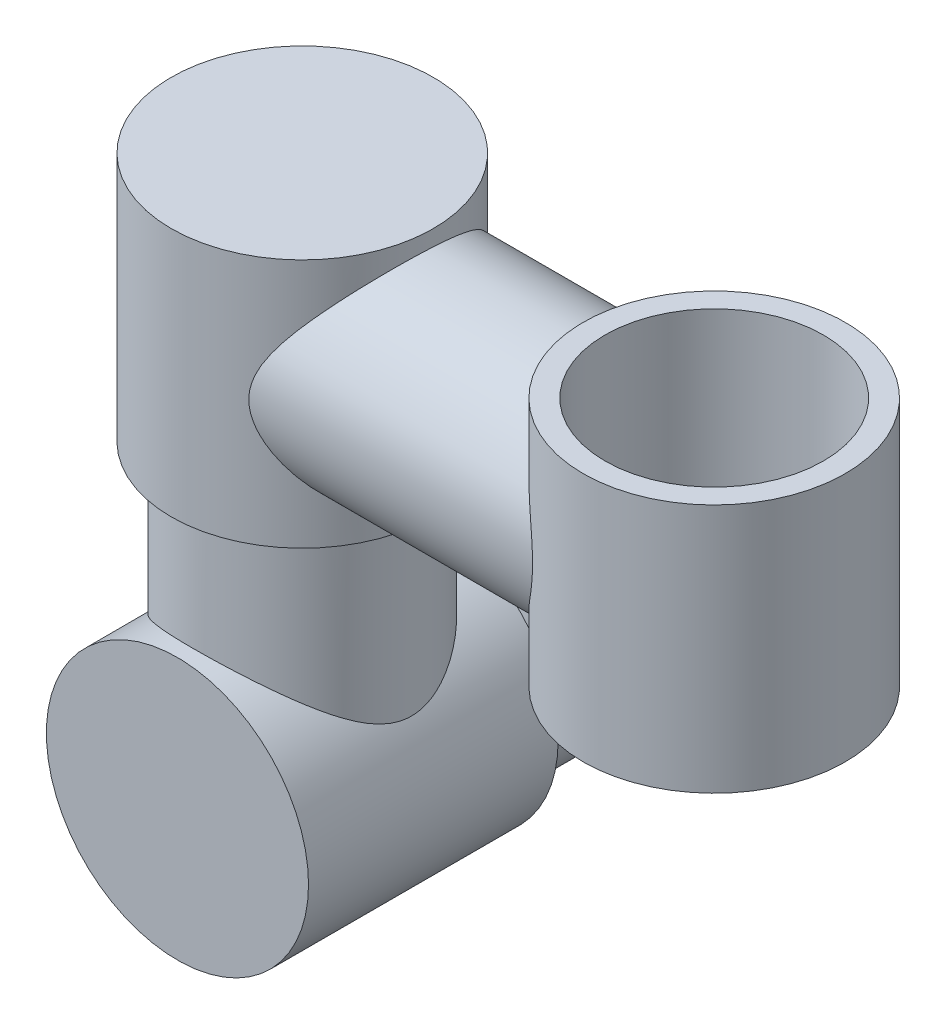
ISO-10303-21;
HEADER;
FILE_DESCRIPTION(('STEP AP214'),'2;1');
FILE_NAME('part.step','',(''),(''),'','','');
FILE_SCHEMA(('AUTOMOTIVE_DESIGN { 1 0 10303 214 1 1 1 1 }'));
ENDSEC;
DATA;
#1=APPLICATION_CONTEXT('core data for automotive mechanical design processes');
#2=APPLICATION_PROTOCOL_DEFINITION('international standard','automotive_design',2000,#1);
#3=PRODUCT_CONTEXT('',#1,'mechanical');
#4=PRODUCT('Part','Part','',(#3));
#5=PRODUCT_RELATED_PRODUCT_CATEGORY('part','',(#4));
#6=PRODUCT_DEFINITION_FORMATION('','',#4);
#7=PRODUCT_DEFINITION_CONTEXT('part definition',#1,'design');
#8=PRODUCT_DEFINITION('design','',#6,#7);
#9=PRODUCT_DEFINITION_SHAPE('','',#8);
#10=(LENGTH_UNIT() NAMED_UNIT(*) SI_UNIT(.MILLI.,.METRE.));
#11=(NAMED_UNIT(*) PLANE_ANGLE_UNIT() SI_UNIT($,.RADIAN.));
#12=(NAMED_UNIT(*) SI_UNIT($,.STERADIAN.) SOLID_ANGLE_UNIT());
#13=UNCERTAINTY_MEASURE_WITH_UNIT(LENGTH_MEASURE(1.E-05),#10,'distance_accuracy_value','');
#14=(GEOMETRIC_REPRESENTATION_CONTEXT(3) GLOBAL_UNCERTAINTY_ASSIGNED_CONTEXT((#13)) GLOBAL_UNIT_ASSIGNED_CONTEXT((#10,
#11,#12)) REPRESENTATION_CONTEXT('',''));
#15=CARTESIAN_POINT('',(0.,0.,0.));
#16=DIRECTION('',(0.,0.,1.));
#17=DIRECTION('',(1.,0.,0.));
#18=AXIS2_PLACEMENT_3D('',#15,#16,#17);
#19=CARTESIAN_POINT('',(620.,610.,210.));
#20=DIRECTION('',(-1.,0.,0.));
#21=DIRECTION('',(0.,0.,1.));
#22=AXIS2_PLACEMENT_3D('',#19,#20,#21);
#23=CYLINDRICAL_SURFACE('',#22,175.);
#24=CARTESIAN_POINT('',(99.373034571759,610.,385.));
#25=CARTESIAN_POINT('',(99.3730399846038,608.622299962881,384.99999824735));
#26=CARTESIAN_POINT('',(99.4033644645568,607.244527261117,384.983718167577));
#27=CARTESIAN_POINT('',(99.5242197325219,604.492215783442,384.918723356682));
#28=CARTESIAN_POINT('',(99.6147604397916,603.117677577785,384.870003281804));
#29=CARTESIAN_POINT('',(99.8547491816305,600.374600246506,384.740487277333));
#30=CARTESIAN_POINT('',(100.004226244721,599.006064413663,384.659675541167));
#31=CARTESIAN_POINT('',(100.359933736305,596.278608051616,384.466594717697));
#32=CARTESIAN_POINT('',(100.566166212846,594.919687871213,384.354324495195));
#33=CARTESIAN_POINT('',(101.033257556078,592.21009932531,384.098755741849));
#34=CARTESIAN_POINT('',(101.294275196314,590.859466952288,383.955366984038));
#35=CARTESIAN_POINT('',(101.867253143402,588.172630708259,383.638693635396));
#36=CARTESIAN_POINT('',(102.179213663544,586.836426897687,383.465408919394));
#37=CARTESIAN_POINT('',(102.850440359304,584.180168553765,383.089963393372));
#38=CARTESIAN_POINT('',(103.209704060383,582.860113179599,382.8878040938));
#39=CARTESIAN_POINT('',(103.971801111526,580.23722081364,382.455628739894));
#40=CARTESIAN_POINT('',(104.374637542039,578.934385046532,382.225610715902));
#41=CARTESIAN_POINT('',(105.40626931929,575.776991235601,381.631527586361));
#42=CARTESIAN_POINT('',(106.056454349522,573.932103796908,381.25303618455));
#43=CARTESIAN_POINT('',(107.428466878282,570.280943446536,380.443229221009));
#44=CARTESIAN_POINT('',(108.150303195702,568.474675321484,380.011907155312));
#45=CARTESIAN_POINT('',(109.655795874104,564.9001247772,379.098804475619));
#46=CARTESIAN_POINT('',(110.43948137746,563.13186077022,378.617000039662));
#47=CARTESIAN_POINT('',(112.059178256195,559.633646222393,377.605327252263));
#48=CARTESIAN_POINT('',(112.895188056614,557.903694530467,377.075460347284));
#49=CARTESIAN_POINT('',(114.613988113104,554.475873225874,375.967844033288));
#50=CARTESIAN_POINT('',(115.496910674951,552.778114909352,375.389956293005));
#51=CARTESIAN_POINT('',(117.300018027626,549.418759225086,374.189204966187));
#52=CARTESIAN_POINT('',(118.220202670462,547.757161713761,373.566341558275));
#53=CARTESIAN_POINT('',(120.091387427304,544.469030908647,372.276955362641));
#54=CARTESIAN_POINT('',(121.042382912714,542.842492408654,371.610439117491));
#55=CARTESIAN_POINT('',(122.969837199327,539.622910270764,370.234608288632));
#56=CARTESIAN_POINT('',(123.94629727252,538.029868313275,369.525291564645));
#57=CARTESIAN_POINT('',(126.559282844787,533.854134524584,367.5912827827));
#58=CARTESIAN_POINT('',(128.21348757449,531.299116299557,366.330488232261));
#59=CARTESIAN_POINT('',(131.559295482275,526.272450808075,363.696936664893));
#60=CARTESIAN_POINT('',(133.250902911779,523.800813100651,362.324166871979));
#61=CARTESIAN_POINT('',(136.657073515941,518.936753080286,359.46720072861));
#62=CARTESIAN_POINT('',(138.371648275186,516.544373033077,357.982946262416));
#63=CARTESIAN_POINT('',(141.809777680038,511.838515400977,354.904203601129));
#64=CARTESIAN_POINT('',(143.533331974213,509.525034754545,353.309719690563));
#65=CARTESIAN_POINT('',(146.97677195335,504.978062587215,350.011693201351));
#66=CARTESIAN_POINT('',(148.696659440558,502.744510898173,348.30823546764));
#67=CARTESIAN_POINT('',(152.123871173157,498.356081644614,344.790738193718));
#68=CARTESIAN_POINT('',(153.831195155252,496.20120572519,342.976696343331));
#69=CARTESIAN_POINT('',(157.223029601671,491.972721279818,339.238238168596));
#70=CARTESIAN_POINT('',(158.907548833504,489.899080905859,337.313865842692));
#71=CARTESIAN_POINT('',(162.245317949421,485.834958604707,333.353524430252));
#72=CARTESIAN_POINT('',(163.898569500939,483.844472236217,331.3175613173));
#73=CARTESIAN_POINT('',(166.825346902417,480.355213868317,327.568504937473));
#74=CARTESIAN_POINT('',(168.10635935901,478.840248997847,325.876287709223));
#75=CARTESIAN_POINT('',(170.638896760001,475.866990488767,322.421218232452));
#76=CARTESIAN_POINT('',(171.890420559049,474.408699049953,320.658363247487));
#77=CARTESIAN_POINT('',(174.359460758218,471.551524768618,317.062102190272));
#78=CARTESIAN_POINT('',(175.576977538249,470.152641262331,315.228696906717));
#79=CARTESIAN_POINT('',(177.973543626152,467.417230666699,311.49145875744));
#80=CARTESIAN_POINT('',(179.152592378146,466.080704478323,309.587624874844));
#81=CARTESIAN_POINT('',(181.466006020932,463.475176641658,305.712692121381));
#82=CARTESIAN_POINT('',(182.600430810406,462.206083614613,303.74169054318));
#83=CARTESIAN_POINT('',(184.821555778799,459.737178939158,299.730872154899));
#84=CARTESIAN_POINT('',(185.908260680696,458.537360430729,297.69106219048));
#85=CARTESIAN_POINT('',(188.029182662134,456.210927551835,293.543841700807));
#86=CARTESIAN_POINT('',(189.063405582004,455.084305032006,291.436438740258));
#87=CARTESIAN_POINT('',(191.074621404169,452.908327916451,287.155499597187));
#88=CARTESIAN_POINT('',(192.051617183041,451.858969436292,284.981966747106));
#89=CARTESIAN_POINT('',(193.75786985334,450.039798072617,281.003759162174));
#90=CARTESIAN_POINT('',(194.498123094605,449.255533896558,279.210387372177));
#91=CARTESIAN_POINT('',(195.935954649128,447.742089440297,275.583769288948));
#92=CARTESIAN_POINT('',(196.63353461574,447.012907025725,273.750524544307));
#93=CARTESIAN_POINT('',(197.983457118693,445.612033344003,270.045963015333));
#94=CARTESIAN_POINT('',(198.635803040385,444.940337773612,268.174649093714));
#95=CARTESIAN_POINT('',(199.892834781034,443.656745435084,264.395803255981));
#96=CARTESIAN_POINT('',(200.497520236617,443.044849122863,262.488271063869));
#97=CARTESIAN_POINT('',(201.656598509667,441.883416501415,258.640027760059));
#98=CARTESIAN_POINT('',(202.211009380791,441.333857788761,256.699328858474));
#99=CARTESIAN_POINT('',(203.267473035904,440.299118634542,252.786744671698));
#100=CARTESIAN_POINT('',(203.769525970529,439.813938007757,250.81485947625));
#101=CARTESIAN_POINT('',(204.719123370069,438.910097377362,246.842825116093));
#102=CARTESIAN_POINT('',(205.166666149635,438.491439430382,244.842675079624));
#103=CARTESIAN_POINT('',(206.005240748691,437.722662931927,240.817484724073));
#104=CARTESIAN_POINT('',(206.396272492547,437.372544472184,238.792444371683));
#105=CARTESIAN_POINT('',(207.122183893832,436.740800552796,234.70916359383));
#106=CARTESIAN_POINT('',(207.456720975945,436.459588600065,232.650798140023));
#107=CARTESIAN_POINT('',(208.065310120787,435.969913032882,228.516527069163));
#108=CARTESIAN_POINT('',(208.339362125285,435.761449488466,226.440621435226));
#109=CARTESIAN_POINT('',(208.825764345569,435.418559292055,222.275466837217));
#110=CARTESIAN_POINT('',(209.038113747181,435.28413361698,220.186217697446));
#111=CARTESIAN_POINT('',(209.400223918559,435.090289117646,215.998828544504));
#112=CARTESIAN_POINT('',(209.549984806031,435.030870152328,213.90068854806));
#113=CARTESIAN_POINT('',(209.786371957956,434.987657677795,209.700580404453));
#114=CARTESIAN_POINT('',(209.873013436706,435.003845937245,207.598613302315));
#115=CARTESIAN_POINT('',(209.983082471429,435.112052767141,203.394963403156));
#116=CARTESIAN_POINT('',(210.006509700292,435.204071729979,201.293280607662));
#117=CARTESIAN_POINT('',(209.990397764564,435.463804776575,197.094975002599));
#118=CARTESIAN_POINT('',(209.95086238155,435.631514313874,194.998351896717));
#119=CARTESIAN_POINT('',(209.809460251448,436.042133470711,190.814627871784));
#120=CARTESIAN_POINT('',(209.707594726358,436.285041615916,188.727526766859));
#121=CARTESIAN_POINT('',(209.454895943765,436.819086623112,184.761266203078));
#122=CARTESIAN_POINT('',(209.309514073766,437.103614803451,182.880863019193));
#123=CARTESIAN_POINT('',(208.969319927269,437.732937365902,179.134705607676));
#124=CARTESIAN_POINT('',(208.774508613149,438.077730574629,177.268951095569));
#125=CARTESIAN_POINT('',(208.336674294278,438.826501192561,173.555230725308));
#126=CARTESIAN_POINT('',(208.093655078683,439.230473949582,171.707263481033));
#127=CARTESIAN_POINT('',(207.560789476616,440.096399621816,168.031781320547));
#128=CARTESIAN_POINT('',(207.270942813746,440.558352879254,166.204266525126));
#129=CARTESIAN_POINT('',(206.645936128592,441.538947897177,162.572020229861));
#130=CARTESIAN_POINT('',(206.310768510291,442.057599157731,160.76729260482));
#131=CARTESIAN_POINT('',(205.596869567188,443.150035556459,157.183346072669));
#132=CARTESIAN_POINT('',(205.218138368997,443.723820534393,155.404127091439));
#133=CARTESIAN_POINT('',(204.418943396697,444.92494750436,151.873377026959));
#134=CARTESIAN_POINT('',(203.998479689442,445.552289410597,150.121845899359));
#135=CARTESIAN_POINT('',(203.117711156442,446.85894729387,146.648278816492));
#136=CARTESIAN_POINT('',(202.657402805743,447.538267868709,144.926245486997));
#137=CARTESIAN_POINT('',(201.672371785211,448.986276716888,141.418824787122));
#138=CARTESIAN_POINT('',(201.145491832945,449.757832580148,139.635227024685));
#139=CARTESIAN_POINT('',(200.051989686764,451.355018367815,136.104639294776));
#140=CARTESIAN_POINT('',(199.485363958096,452.18065310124,134.357652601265));
#141=CARTESIAN_POINT('',(198.31491407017,453.883922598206,130.902083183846));
#142=CARTESIAN_POINT('',(197.711092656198,454.761553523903,129.193497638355));
#143=CARTESIAN_POINT('',(196.468703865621,456.566960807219,125.815854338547));
#144=CARTESIAN_POINT('',(195.830133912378,457.494740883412,124.14679952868));
#145=CARTESIAN_POINT('',(193.866303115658,460.350142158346,119.201272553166));
#146=CARTESIAN_POINT('',(192.492578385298,462.350321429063,115.985432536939));
#147=CARTESIAN_POINT('',(189.636328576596,466.529695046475,109.723149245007));
#148=CARTESIAN_POINT('',(188.153797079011,468.708899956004,106.676715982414));
#149=CARTESIAN_POINT('',(185.720465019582,472.314580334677,101.960110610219));
#150=CARTESIAN_POINT('',(184.798299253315,473.687236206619,100.233571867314));
#151=CARTESIAN_POINT('',(182.926835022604,476.489104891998,96.8422412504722));
#152=CARTESIAN_POINT('',(181.977537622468,477.918315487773,95.1774469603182));
#153=CARTESIAN_POINT('',(180.055871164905,480.831456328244,91.9098692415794));
#154=CARTESIAN_POINT('',(179.083499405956,482.315392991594,90.3070931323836));
#155=CARTESIAN_POINT('',(177.11998539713,485.336098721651,87.1640830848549));
#156=CARTESIAN_POINT('',(176.128843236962,486.872867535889,85.6238488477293));
#157=CARTESIAN_POINT('',(174.129474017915,490.001783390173,82.6023148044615));
#158=CARTESIAN_POINT('',(173.121209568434,491.594062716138,81.1211767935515));
#159=CARTESIAN_POINT('',(171.094479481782,494.8290122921,78.2223057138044));
#160=CARTESIAN_POINT('',(170.076013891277,496.471682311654,76.8045723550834));
#161=CARTESIAN_POINT('',(168.033382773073,499.806487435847,74.032758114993));
#162=CARTESIAN_POINT('',(167.009217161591,501.498623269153,72.6786781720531));
#163=CARTESIAN_POINT('',(164.959906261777,504.931653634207,70.034514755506));
#164=CARTESIAN_POINT('',(163.934760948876,506.672549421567,68.7444329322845));
#165=CARTESIAN_POINT('',(161.670258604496,510.579036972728,65.9604662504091));
#166=CARTESIAN_POINT('',(160.431836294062,512.756032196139,64.4817818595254));
#167=CARTESIAN_POINT('',(157.970344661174,517.180732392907,61.6203335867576));
#168=CARTESIAN_POINT('',(156.747275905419,519.428439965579,60.2375732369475));
#169=CARTESIAN_POINT('',(154.326322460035,523.995682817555,57.5688471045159));
#170=CARTESIAN_POINT('',(153.128450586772,526.315253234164,56.2829297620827));
#171=CARTESIAN_POINT('',(150.770070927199,531.02541689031,53.8107256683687));
#172=CARTESIAN_POINT('',(149.609562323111,533.416008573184,52.6244367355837));
#173=CARTESIAN_POINT('',(147.342310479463,538.261026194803,50.3577434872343));
#174=CARTESIAN_POINT('',(146.235409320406,540.715227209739,49.2770172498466));
#175=CARTESIAN_POINT('',(144.08563455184,545.695051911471,47.2206079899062));
#176=CARTESIAN_POINT('',(143.042764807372,548.220679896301,46.2449313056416));
#177=CARTESIAN_POINT('',(141.037899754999,553.340410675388,44.4038507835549));
#178=CARTESIAN_POINT('',(140.07583102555,555.934448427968,43.5383464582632));
#179=CARTESIAN_POINT('',(138.248972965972,561.191340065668,41.9218254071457));
#180=CARTESIAN_POINT('',(137.384162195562,563.854178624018,41.1707834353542));
#181=CARTESIAN_POINT('',(136.122329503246,568.069107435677,40.0904309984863));
#182=CARTESIAN_POINT('',(135.68581118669,569.599024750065,39.7200665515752));
#183=CARTESIAN_POINT('',(134.8529311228,572.678641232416,39.0186863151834));
#184=CARTESIAN_POINT('',(134.456566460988,574.228338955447,38.6876676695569));
#185=CARTESIAN_POINT('',(133.707365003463,577.346182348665,38.0661322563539));
#186=CARTESIAN_POINT('',(133.354525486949,578.914326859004,37.7756129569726));
#187=CARTESIAN_POINT('',(132.695630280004,582.067384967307,37.2362109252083));
#188=CARTESIAN_POINT('',(132.389569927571,583.652296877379,36.9873240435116));
#189=CARTESIAN_POINT('',(131.827826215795,586.833726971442,36.5327109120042));
#190=CARTESIAN_POINT('',(131.572039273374,588.430214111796,36.3268958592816));
#191=CARTESIAN_POINT('',(131.112763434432,591.635694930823,35.9587553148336));
#192=CARTESIAN_POINT('',(130.909274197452,593.244688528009,35.7964295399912));
#193=CARTESIAN_POINT('',(130.556871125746,596.472540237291,35.5160975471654));
#194=CARTESIAN_POINT('',(130.407958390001,598.091398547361,35.3980922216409));
#195=CARTESIAN_POINT('',(130.166459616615,601.335974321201,35.2070494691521));
#196=CARTESIAN_POINT('',(130.073873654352,602.961691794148,35.1340121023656));
#197=CARTESIAN_POINT('',(129.945850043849,606.224396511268,35.0330858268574));
#198=CARTESIAN_POINT('',(129.910681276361,607.861400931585,35.005409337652));
#199=CARTESIAN_POINT('',(129.898764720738,611.135754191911,34.9960273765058));
#200=CARTESIAN_POINT('',(129.922016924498,612.773103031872,35.0143218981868));
#201=CARTESIAN_POINT('',(130.026652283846,616.044744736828,35.0967735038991));
#202=CARTESIAN_POINT('',(130.108034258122,617.679037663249,35.160929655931));
#203=CARTESIAN_POINT('',(130.327930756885,620.941338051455,35.3347333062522));
#204=CARTESIAN_POINT('',(130.466445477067,622.569345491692,35.444380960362));
#205=CARTESIAN_POINT('',(130.799190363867,625.818283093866,35.7087435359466));
#206=CARTESIAN_POINT('',(130.993498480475,627.439200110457,35.8635215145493));
#207=CARTESIAN_POINT('',(131.435522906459,630.668841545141,36.2172678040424));
#208=CARTESIAN_POINT('',(131.683238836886,632.277566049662,36.4162358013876));
#209=CARTESIAN_POINT('',(132.229420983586,635.480553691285,36.8574138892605));
#210=CARTESIAN_POINT('',(132.527892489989,637.074815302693,37.0996284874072));
#211=CARTESIAN_POINT('',(133.172538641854,640.246669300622,37.6262088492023));
#212=CARTESIAN_POINT('',(133.518715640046,641.824260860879,37.9105766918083));
#213=CARTESIAN_POINT('',(134.363489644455,645.42070590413,38.6096808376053));
#214=CARTESIAN_POINT('',(134.877024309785,647.433390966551,39.0382006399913));
#215=CARTESIAN_POINT('',(135.971064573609,651.425139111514,39.9613122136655));
#216=CARTESIAN_POINT('',(136.551575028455,653.404199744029,40.4559087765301));
#217=CARTESIAN_POINT('',(137.77229727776,657.327147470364,41.508852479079));
#218=CARTESIAN_POINT('',(138.412524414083,659.271025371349,42.0672160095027));
#219=CARTESIAN_POINT('',(139.74531779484,663.12177554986,43.2452964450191));
#220=CARTESIAN_POINT('',(140.437883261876,665.028648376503,43.8650124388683));
#221=CARTESIAN_POINT('',(141.87030815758,668.809532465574,45.1653989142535));
#222=CARTESIAN_POINT('',(142.61028392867,670.683447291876,45.8462211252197));
#223=CARTESIAN_POINT('',(144.129420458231,674.393056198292,47.2656202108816));
#224=CARTESIAN_POINT('',(144.908581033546,676.228750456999,48.0041968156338));
#225=CARTESIAN_POINT('',(146.500025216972,679.861821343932,49.537501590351));
#226=CARTESIAN_POINT('',(147.312307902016,681.659199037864,50.3322281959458));
#227=CARTESIAN_POINT('',(148.964455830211,685.215818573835,51.9765235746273));
#228=CARTESIAN_POINT('',(149.804322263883,686.975058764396,52.8260947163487));
#229=CARTESIAN_POINT('',(151.838845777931,691.135175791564,54.9212302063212));
#230=CARTESIAN_POINT('',(153.043977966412,693.518346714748,56.1918792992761));
#231=CARTESIAN_POINT('',(155.484996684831,698.211644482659,58.8346626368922));
#232=CARTESIAN_POINT('',(156.720885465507,700.521765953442,60.2068043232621));
#233=CARTESIAN_POINT('',(159.212488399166,705.069772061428,63.0512522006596));
#234=CARTESIAN_POINT('',(160.468209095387,707.307632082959,64.5235920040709));
#235=CARTESIAN_POINT('',(162.988736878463,711.709975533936,67.5667140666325));
#236=CARTESIAN_POINT('',(164.25354374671,713.874460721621,69.1374939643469));
#237=CARTESIAN_POINT('',(166.782238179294,718.128430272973,72.3759278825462));
#238=CARTESIAN_POINT('',(168.046125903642,720.217947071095,74.0435391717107));
#239=CARTESIAN_POINT('',(170.564690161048,724.321697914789,77.4756461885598));
#240=CARTESIAN_POINT('',(171.81936655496,726.335930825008,79.2401433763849));
#241=CARTESIAN_POINT('',(174.310706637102,730.286621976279,82.8649797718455));
#242=CARTESIAN_POINT('',(175.547375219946,732.223101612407,84.725292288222));
#243=CARTESIAN_POINT('',(177.994887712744,736.016319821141,88.5416745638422));
#244=CARTESIAN_POINT('',(179.205732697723,737.873061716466,90.4977403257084));
#245=CARTESIAN_POINT('',(181.389235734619,741.19290641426,94.1619987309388));
#246=CARTESIAN_POINT('',(182.367185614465,742.668984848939,95.8553042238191));
#247=CARTESIAN_POINT('',(184.295466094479,745.562241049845,99.3069554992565));
#248=CARTESIAN_POINT('',(185.245795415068,746.979416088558,101.065304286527));
#249=CARTESIAN_POINT('',(187.11425892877,749.752355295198,104.646276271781));
#250=CARTESIAN_POINT('',(188.032394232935,751.108121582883,106.468897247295));
#251=CARTESIAN_POINT('',(189.832028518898,753.75567925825,110.177678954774));
#252=CARTESIAN_POINT('',(190.713527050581,755.047469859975,112.063840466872));
#253=CARTESIAN_POINT('',(192.434239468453,757.562522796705,115.896079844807));
#254=CARTESIAN_POINT('',(193.273507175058,758.785872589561,117.842076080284));
#255=CARTESIAN_POINT('',(194.906406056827,761.162651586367,121.79472688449));
#256=CARTESIAN_POINT('',(195.700041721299,762.316087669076,123.801375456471));
#257=CARTESIAN_POINT('',(197.237187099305,764.549781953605,127.873528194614));
#258=CARTESIAN_POINT('',(197.980701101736,765.630046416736,129.939027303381));
#259=CARTESIAN_POINT('',(199.413168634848,767.714043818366,134.126752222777));
#260=CARTESIAN_POINT('',(200.102124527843,768.717780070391,136.248975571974));
#261=CARTESIAN_POINT('',(201.307044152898,770.478597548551,140.175824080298));
#262=CARTESIAN_POINT('',(201.832324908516,771.248323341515,141.971935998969));
#263=CARTESIAN_POINT('',(202.840082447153,772.731003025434,145.599229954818));
#264=CARTESIAN_POINT('',(203.32256074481,773.443958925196,147.430410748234));
#265=CARTESIAN_POINT('',(204.24230998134,774.811072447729,151.125633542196));
#266=CARTESIAN_POINT('',(204.679584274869,775.465234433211,152.989673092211));
#267=CARTESIAN_POINT('',(205.506690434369,776.712883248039,156.748374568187));
#268=CARTESIAN_POINT('',(205.896521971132,777.306369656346,158.643036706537));
#269=CARTESIAN_POINT('',(206.626448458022,778.430588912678,162.45956873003));
#270=CARTESIAN_POINT('',(206.96656220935,778.96134546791,164.381428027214));
#271=CARTESIAN_POINT('',(207.595240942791,779.958629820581,168.250097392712));
#272=CARTESIAN_POINT('',(207.883806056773,780.425157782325,170.196907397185));
#273=CARTESIAN_POINT('',(208.407602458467,781.292423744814,174.112310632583));
#274=CARTESIAN_POINT('',(208.642832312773,781.693159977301,176.080904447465));
#275=CARTESIAN_POINT('',(209.058382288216,782.42745096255,180.036350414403));
#276=CARTESIAN_POINT('',(209.238702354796,782.761005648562,182.023202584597));
#277=CARTESIAN_POINT('',(209.543741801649,783.361005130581,186.019567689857));
#278=CARTESIAN_POINT('',(209.668232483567,783.627171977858,188.029139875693));
#279=CARTESIAN_POINT('',(209.859501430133,784.089734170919,192.059042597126));
#280=CARTESIAN_POINT('',(209.926279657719,784.286129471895,194.079373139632));
#281=CARTESIAN_POINT('',(210.001399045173,784.608553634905,198.126740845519));
#282=CARTESIAN_POINT('',(210.009739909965,784.734582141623,200.153778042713));
#283=CARTESIAN_POINT('',(209.967585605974,784.915987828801,204.210400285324));
#284=CARTESIAN_POINT('',(209.917090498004,784.971365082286,206.239985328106));
#285=CARTESIAN_POINT('',(209.757203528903,785.011506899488,210.297455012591));
#286=CARTESIAN_POINT('',(209.647813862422,784.996274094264,212.325339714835));
#287=CARTESIAN_POINT('',(209.370408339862,784.89556353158,216.375347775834));
#288=CARTESIAN_POINT('',(209.202392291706,784.810085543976,218.397471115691));
#289=CARTESIAN_POINT('',(208.80833499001,784.569564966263,222.431830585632));
#290=CARTESIAN_POINT('',(208.582295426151,784.414524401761,224.44406700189));
#291=CARTESIAN_POINT('',(208.073091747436,784.035853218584,228.454783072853));
#292=CARTESIAN_POINT('',(207.789928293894,783.812223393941,230.453262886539));
#293=CARTESIAN_POINT('',(207.187489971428,783.31401736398,234.305973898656));
#294=CARTESIAN_POINT('',(206.871664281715,783.043593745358,236.161284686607));
#295=CARTESIAN_POINT('',(206.192160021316,782.44493300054,239.853694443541));
#296=CARTESIAN_POINT('',(205.828482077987,782.116696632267,241.690793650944));
#297=CARTESIAN_POINT('',(205.05465465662,781.403815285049,245.343957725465));
#298=CARTESIAN_POINT('',(204.644509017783,781.019174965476,247.160024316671));
#299=CARTESIAN_POINT('',(203.779219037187,780.19497388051,250.768819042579));
#300=CARTESIAN_POINT('',(203.324074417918,779.755412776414,252.561547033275));
#301=CARTESIAN_POINT('',(202.370340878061,778.822919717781,256.121668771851));
#302=CARTESIAN_POINT('',(201.871745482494,778.32997980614,257.889058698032));
#303=CARTESIAN_POINT('',(200.832898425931,777.29248672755,261.396186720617));
#304=CARTESIAN_POINT('',(200.292647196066,776.747934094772,263.135925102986));
#305=CARTESIAN_POINT('',(199.172215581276,775.608893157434,266.586175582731));
#306=CARTESIAN_POINT('',(198.592030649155,775.014399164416,268.296684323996));
#307=CARTESIAN_POINT('',(197.393630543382,773.777298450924,271.686729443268));
#308=CARTESIAN_POINT('',(196.77541390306,773.134689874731,273.366264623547));
#309=CARTESIAN_POINT('',(195.291612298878,771.582130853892,277.24514269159));
#310=CARTESIAN_POINT('',(194.412029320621,770.654240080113,279.431987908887));
#311=CARTESIAN_POINT('',(192.593232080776,768.72042417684,283.745607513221));
#312=CARTESIAN_POINT('',(191.65401398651,767.714494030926,285.872378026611));
#313=CARTESIAN_POINT('',(189.720336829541,765.628528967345,290.063987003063));
#314=CARTESIAN_POINT('',(188.725869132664,764.548482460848,292.128815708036));
#315=CARTESIAN_POINT('',(186.686201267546,762.318209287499,296.194781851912));
#316=CARTESIAN_POINT('',(185.640995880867,761.167975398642,298.195912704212));
#317=CARTESIAN_POINT('',(183.502490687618,758.799041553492,302.136526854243));
#318=CARTESIAN_POINT('',(182.409110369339,757.580225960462,304.075896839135));
#319=CARTESIAN_POINT('',(180.180314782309,755.079418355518,307.888507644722));
#320=CARTESIAN_POINT('',(179.044900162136,753.797427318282,309.761749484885));
#321=CARTESIAN_POINT('',(176.736251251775,751.17338698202,313.441683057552));
#322=CARTESIAN_POINT('',(175.563016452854,749.831336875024,315.248373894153));
#323=CARTESIAN_POINT('',(173.182979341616,747.09012946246,318.794849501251));
#324=CARTESIAN_POINT('',(171.976178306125,745.690974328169,320.534636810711));
#325=CARTESIAN_POINT('',(169.187324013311,742.434325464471,324.43029342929));
#326=CARTESIAN_POINT('',(167.595714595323,740.559166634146,326.56459693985));
#327=CARTESIAN_POINT('',(164.372414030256,736.72348347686,330.723493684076));
#328=CARTESIAN_POINT('',(162.740720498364,734.762954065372,332.74808036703));
#329=CARTESIAN_POINT('',(159.445290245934,730.759542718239,336.688692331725));
#330=CARTESIAN_POINT('',(157.78154199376,728.716630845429,338.604677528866));
#331=CARTESIAN_POINT('',(154.431401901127,724.55193307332,342.327836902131));
#332=CARTESIAN_POINT('',(152.745010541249,722.43014884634,344.135013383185));
#333=CARTESIAN_POINT('',(149.358369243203,718.108994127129,347.641524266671));
#334=CARTESIAN_POINT('',(147.658116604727,715.909608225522,349.340837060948));
#335=CARTESIAN_POINT('',(144.253850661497,711.434302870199,352.631683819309));
#336=CARTESIAN_POINT('',(142.549837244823,709.15838110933,354.223214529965));
#337=CARTESIAN_POINT('',(139.149696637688,704.530725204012,357.297848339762));
#338=CARTESIAN_POINT('',(137.453566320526,702.179024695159,358.780998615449));
#339=CARTESIAN_POINT('',(134.08078395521,697.397451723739,361.639188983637));
#340=CARTESIAN_POINT('',(132.404130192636,694.967586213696,363.014238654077));
#341=CARTESIAN_POINT('',(129.728155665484,690.9846403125,365.143252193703));
#342=CARTESIAN_POINT('',(128.718224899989,689.456821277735,365.93134554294));
#343=CARTESIAN_POINT('',(126.714889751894,686.369934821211,367.466200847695));
#344=CARTESIAN_POINT('',(125.721484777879,684.810868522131,368.212964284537));
#345=CARTESIAN_POINT('',(123.755397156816,681.660355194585,369.66465465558));
#346=CARTESIAN_POINT('',(122.782715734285,680.068906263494,370.369579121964));
#347=CARTESIAN_POINT('',(120.862980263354,676.852532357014,371.736800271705));
#348=CARTESIAN_POINT('',(119.915926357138,675.227607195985,372.399096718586));
#349=CARTESIAN_POINT('',(118.054235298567,671.945230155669,373.679221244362));
#350=CARTESIAN_POINT('',(117.139556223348,670.287825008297,374.297107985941));
#351=CARTESIAN_POINT('',(115.347551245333,666.93702942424,375.488175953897));
#352=CARTESIAN_POINT('',(114.470226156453,665.243638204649,376.061356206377));
#353=CARTESIAN_POINT('',(112.760392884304,661.820177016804,377.161301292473));
#354=CARTESIAN_POINT('',(111.927870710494,660.090118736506,377.688080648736));
#355=CARTESIAN_POINT('',(110.31561450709,656.591989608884,378.69350316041));
#356=CARTESIAN_POINT('',(109.535875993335,654.823922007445,379.172150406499));
#357=CARTESIAN_POINT('',(107.745820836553,650.55098601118,380.256257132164));
#358=CARTESIAN_POINT('',(106.764312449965,648.027918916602,380.838282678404));
#359=CARTESIAN_POINT('',(104.948447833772,642.906906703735,381.898132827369));
#360=CARTESIAN_POINT('',(104.114100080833,640.308957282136,382.375951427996));
#361=CARTESIAN_POINT('',(102.997005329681,636.365140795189,383.007647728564));
#362=CARTESIAN_POINT('',(102.647457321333,635.044680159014,383.203816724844));
#363=CARTESIAN_POINT('',(101.996210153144,632.388122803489,383.567187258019));
#364=CARTESIAN_POINT('',(101.694505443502,631.052027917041,383.734392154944));
#365=CARTESIAN_POINT('',(101.142610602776,628.366526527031,384.038777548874));
#366=CARTESIAN_POINT('',(100.892395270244,627.017126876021,384.175972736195));
#367=CARTESIAN_POINT('',(100.446533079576,624.306725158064,384.419518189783));
#368=CARTESIAN_POINT('',(100.250877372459,622.945725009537,384.525873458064));
#369=CARTESIAN_POINT('',(99.9665214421,620.621310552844,384.680026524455));
#370=CARTESIAN_POINT('',(99.863321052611,619.660172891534,384.735830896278));
#371=CARTESIAN_POINT('',(99.6858692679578,617.734609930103,384.831646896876));
#372=CARTESIAN_POINT('',(99.6116122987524,616.770185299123,384.871661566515));
#373=CARTESIAN_POINT('',(99.4925633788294,614.838842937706,384.935757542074));
#374=CARTESIAN_POINT('',(99.4477757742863,613.871924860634,384.959836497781));
#375=CARTESIAN_POINT('',(99.3880058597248,611.936683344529,384.991960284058));
#376=CARTESIAN_POINT('',(99.3730307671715,610.968359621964,385.000001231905));
#377=CARTESIAN_POINT('',(99.373034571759,610.,385.));
#378=B_SPLINE_CURVE_WITH_KNOTS('',3,(#24,#25,#26,#27,#28,#29,#30,#31,#32,#33,#34,#35,#36,#37,
#38,#39,#40,#41,#42,#43,#44,#45,#46,#47,#48,#49,#50,#51,#52,#53,#54,#55,#56,#57,#58,#59,#60,#61,
#62,#63,#64,#65,#66,#67,#68,#69,#70,#71,#72,#73,#74,#75,#76,#77,#78,#79,#80,#81,#82,#83,#84,#85,
#86,#87,#88,#89,#90,#91,#92,#93,#94,#95,#96,#97,#98,#99,#100,#101,#102,#103,#104,#105,#106,#107,
#108,#109,#110,#111,#112,#113,#114,#115,#116,#117,#118,#119,#120,#121,#122,#123,#124,#125,#126,
#127,#128,#129,#130,#131,#132,#133,#134,#135,#136,#137,#138,#139,#140,#141,#142,#143,#144,#145,
#146,#147,#148,#149,#150,#151,#152,#153,#154,#155,#156,#157,#158,#159,#160,#161,#162,#163,#164,
#165,#166,#167,#168,#169,#170,#171,#172,#173,#174,#175,#176,#177,#178,#179,#180,#181,#182,#183,
#184,#185,#186,#187,#188,#189,#190,#191,#192,#193,#194,#195,#196,#197,#198,#199,#200,#201,#202,
#203,#204,#205,#206,#207,#208,#209,#210,#211,#212,#213,#214,#215,#216,#217,#218,#219,#220,#221,
#222,#223,#224,#225,#226,#227,#228,#229,#230,#231,#232,#233,#234,#235,#236,#237,#238,#239,#240,
#241,#242,#243,#244,#245,#246,#247,#248,#249,#250,#251,#252,#253,#254,#255,#256,#257,#258,#259,
#260,#261,#262,#263,#264,#265,#266,#267,#268,#269,#270,#271,#272,#273,#274,#275,#276,#277,#278,
#279,#280,#281,#282,#283,#284,#285,#286,#287,#288,#289,#290,#291,#292,#293,#294,#295,#296,#297,
#298,#299,#300,#301,#302,#303,#304,#305,#306,#307,#308,#309,#310,#311,#312,#313,#314,#315,#316,
#317,#318,#319,#320,#321,#322,#323,#324,#325,#326,#327,#328,#329,#330,#331,#332,#333,#334,#335,
#336,#337,#338,#339,#340,#341,#342,#343,#344,#345,#346,#347,#348,#349,#350,#351,#352,#353,#354,
#355,#356,#357,#358,#359,#360,#361,#362,#363,#364,#365,#366,#367,#368,#369,#370,#371,#372,#373,
#374,#375,#376,#377),.UNSPECIFIED.,.T.,.F.,(4,2,2,2,2,2,2,2,2,2,2,2,2,2,2,2,2,2,2,2,2,2,2,2,2,2,
2,2,2,2,2,2,2,2,2,2,2,2,2,2,2,2,2,2,2,2,2,2,2,2,2,2,2,2,2,2,2,2,2,2,2,2,2,2,2,2,2,2,2,2,2,2,2,2,
2,2,2,2,2,2,2,2,2,2,2,2,2,2,2,2,2,2,2,2,2,2,2,2,2,2,2,2,2,2,2,2,2,2,2,2,2,2,2,2,2,2,2,2,2,2,2,2,
2,2,2,2,2,2,2,2,2,2,2,2,2,2,2,2,2,2,2,2,2,2,2,2,2,2,2,2,2,2,2,2,2,2,2,2,2,2,2,2,2,2,2,2,2,2,2,2,
2,2,2,2,2,2,4),(0.,4.13279957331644,8.26628010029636,12.4017990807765,16.5374673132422,
20.6852908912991,24.8331318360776,28.9807558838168,33.1286733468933,39.1030640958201,
45.0781910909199,51.0561504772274,57.0339300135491,63.0295696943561,69.0251855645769,
75.0199048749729,81.0149242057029,90.8949504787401,100.776105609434,110.662447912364,
120.548406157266,130.42675891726,140.305318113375,150.179964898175,160.054083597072,
167.875345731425,175.696911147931,183.51838915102,191.339980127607,199.150686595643,
206.960618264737,214.769678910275,222.578346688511,228.854889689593,235.131189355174,
241.407018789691,247.68289606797,253.956510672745,260.230107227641,266.503897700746,
272.77769657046,279.088269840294,285.398849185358,291.70951179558,298.020162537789,
304.329291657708,310.638453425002,316.94723627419,323.255895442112,328.976330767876,
334.696654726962,340.416529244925,346.136437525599,351.85730568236,357.578157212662,
363.298999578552,369.020348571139,375.059297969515,381.098785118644,387.137827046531,
393.177317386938,405.252787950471,417.328971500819,424.499656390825,431.670060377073,
438.841308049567,446.012521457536,453.202182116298,460.391809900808,467.581543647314,
474.77146270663,483.494513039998,492.217884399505,500.94559054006,509.673105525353,
518.373114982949,527.073649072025,535.766189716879,544.456810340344,549.356425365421,
554.255684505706,559.154637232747,564.053101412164,568.941364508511,573.829595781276,
578.717925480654,583.606261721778,588.517424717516,593.428587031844,598.33964954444,
603.250728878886,608.168703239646,613.086642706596,618.00509507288,622.923790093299,
629.283901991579,635.644475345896,642.006687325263,648.368804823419,654.747181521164,
661.125528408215,667.503697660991,673.882142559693,682.751353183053,691.621214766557,
700.494066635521,709.366705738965,718.23545870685,727.104345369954,735.970774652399,
744.836834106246,752.185195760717,759.53389730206,766.88234498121,774.23088291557,
781.569805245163,788.908004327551,796.245574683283,803.582827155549,809.651762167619,
815.720482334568,821.788751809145,827.857063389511,833.923074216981,839.989069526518,
846.055227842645,852.121392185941,858.212183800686,864.302979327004,870.393805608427,
876.48462559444,882.575218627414,888.665831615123,894.756267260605,900.846632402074,
906.549050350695,912.251393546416,917.953265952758,923.65517352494,929.357932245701,
935.060631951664,940.76398209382,946.46755232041,954.06421674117,961.661369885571,
969.25971363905,976.858840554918,984.471188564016,992.083419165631,999.695752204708,
1007.30779607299,1017.07376960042,1026.84032557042,1036.610463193,1046.38039377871,
1056.15227542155,1065.92445189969,1075.69234902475,1085.45937971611,1091.44017161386,
1097.42074901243,1103.40167881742,1109.38264179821,1115.35555326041,1121.32859480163,
1127.29976019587,1133.27041767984,1141.57177242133,1149.87360517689,1154.01246376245,
1158.15084189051,1162.28718964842,1166.42286614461,1169.32716221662,1172.23089869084,
1175.13506331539,1178.03993093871),.UNSPECIFIED.);
#379=CARTESIAN_POINT('',(99.373034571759,610.,385.));
#380=VERTEX_POINT('',#379);
#381=EDGE_CURVE('E57',#380,#380,#378,.T.);
#382=ORIENTED_EDGE('',*,*,#381,.T.);
#383=EDGE_LOOP('',(#382));
#384=FACE_BOUND('',#383,.T.);
#385=CARTESIAN_POINT('',(553.918132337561,610.,385.));
#386=CARTESIAN_POINT('',(553.918126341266,608.453700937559,384.999997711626));
#387=CARTESIAN_POINT('',(553.887194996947,606.907282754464,384.979490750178));
#388=CARTESIAN_POINT('',(553.76387713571,603.817789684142,384.89759583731));
#389=CARTESIAN_POINT('',(553.671479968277,602.274715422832,384.836200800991));
#390=CARTESIAN_POINT('',(553.42642765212,599.194644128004,384.672905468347));
#391=CARTESIAN_POINT('',(553.273738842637,597.657650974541,384.570982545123));
#392=CARTESIAN_POINT('',(552.910137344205,594.593839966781,384.327312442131));
#393=CARTESIAN_POINT('',(552.699226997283,593.067021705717,384.18556686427));
#394=CARTESIAN_POINT('',(552.221160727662,590.021948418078,383.862671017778));
#395=CARTESIAN_POINT('',(551.953846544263,588.503730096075,383.681409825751));
#396=CARTESIAN_POINT('',(551.366507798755,585.482634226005,383.280757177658));
#397=CARTESIAN_POINT('',(551.046482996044,583.979756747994,383.061365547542));
#398=CARTESIAN_POINT('',(550.357254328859,580.991372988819,382.585598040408));
#399=CARTESIAN_POINT('',(549.988053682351,579.505865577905,382.329224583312));
#400=CARTESIAN_POINT('',(549.2041458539,576.5535622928,381.780646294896));
#401=CARTESIAN_POINT('',(548.789435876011,575.086767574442,381.48843926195));
#402=CARTESIAN_POINT('',(547.749367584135,571.608084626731,380.749326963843));
#403=CARTESIAN_POINT('',(547.104679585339,569.605355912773,380.28636920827));
#404=CARTESIAN_POINT('',(545.744845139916,565.639954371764,379.296673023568));
#405=CARTESIAN_POINT('',(545.029691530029,563.677285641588,378.769928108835));
#406=CARTESIAN_POINT('',(543.53812309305,559.792181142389,377.655184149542));
#407=CARTESIAN_POINT('',(542.761683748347,557.869761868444,377.067160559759));
#408=CARTESIAN_POINT('',(541.156600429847,554.066159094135,375.832456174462));
#409=CARTESIAN_POINT('',(540.327957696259,552.184974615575,375.185776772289));
#410=CARTESIAN_POINT('',(538.624251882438,548.458630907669,373.834057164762));
#411=CARTESIAN_POINT('',(537.749074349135,546.613577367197,373.128870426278));
#412=CARTESIAN_POINT('',(535.961550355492,542.963911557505,371.663322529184));
#413=CARTESIAN_POINT('',(535.049204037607,541.15929913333,370.902961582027));
#414=CARTESIAN_POINT('',(533.193958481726,537.589935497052,369.328550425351));
#415=CARTESIAN_POINT('',(532.251062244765,535.825180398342,368.514505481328));
#416=CARTESIAN_POINT('',(530.340460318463,532.334563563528,366.833772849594));
#417=CARTESIAN_POINT('',(529.372753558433,530.608703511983,365.967082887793));
#418=CARTESIAN_POINT('',(526.982351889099,526.434809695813,363.784301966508));
#419=CARTESIAN_POINT('',(525.549009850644,524.007557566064,362.440006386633));
#420=CARTESIAN_POINT('',(522.655643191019,519.231234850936,359.645205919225));
#421=CARTESIAN_POINT('',(521.195616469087,516.882170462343,358.194692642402));
#422=CARTESIAN_POINT('',(518.260684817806,512.260514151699,355.188137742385));
#423=CARTESIAN_POINT('',(516.785774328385,509.987952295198,353.63205533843));
#424=CARTESIAN_POINT('',(513.832708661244,505.52018217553,350.415611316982));
#425=CARTESIAN_POINT('',(512.354553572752,503.324971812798,348.755252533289));
#426=CARTESIAN_POINT('',(509.406344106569,499.014452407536,345.332094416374));
#427=CARTESIAN_POINT('',(507.936283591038,496.899072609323,343.569389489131));
#428=CARTESIAN_POINT('',(505.012224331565,492.747550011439,339.940233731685));
#429=CARTESIAN_POINT('',(503.558225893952,490.711408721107,338.073780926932));
#430=CARTESIAN_POINT('',(500.675712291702,486.721387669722,334.237835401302));
#431=CARTESIAN_POINT('',(499.24718863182,484.76748017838,332.268377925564));
#432=CARTESIAN_POINT('',(496.423790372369,480.944347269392,328.225957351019));
#433=CARTESIAN_POINT('',(495.02891391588,479.075117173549,326.152999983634));
#434=CARTESIAN_POINT('',(492.572809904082,475.812434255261,322.354642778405));
#435=CARTESIAN_POINT('',(491.503581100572,474.402177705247,320.648812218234));
#436=CARTESIAN_POINT('',(489.39535693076,471.638751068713,317.173196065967));
#437=CARTESIAN_POINT('',(488.356362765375,470.285583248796,315.403407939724));
#438=CARTESIAN_POINT('',(486.312896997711,467.63898399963,311.800477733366));
#439=CARTESIAN_POINT('',(485.308423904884,466.345549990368,309.967338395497));
#440=CARTESIAN_POINT('',(483.338155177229,463.821113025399,306.238259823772));
#441=CARTESIAN_POINT('',(482.372360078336,462.590110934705,304.342319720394));
#442=CARTESIAN_POINT('',(480.484908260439,460.195084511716,300.491010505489));
#443=CARTESIAN_POINT('',(479.563198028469,459.030978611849,298.535718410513));
#444=CARTESIAN_POINT('',(477.767013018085,456.771441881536,294.56492463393));
#445=CARTESIAN_POINT('',(476.892533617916,455.676004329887,292.549428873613));
#446=CARTESIAN_POINT('',(475.195108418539,453.557206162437,288.459895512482));
#447=CARTESIAN_POINT('',(474.372158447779,452.533839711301,286.385862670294));
#448=CARTESIAN_POINT('',(472.782063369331,450.562696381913,282.181275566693));
#449=CARTESIAN_POINT('',(472.014915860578,449.61491625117,280.050723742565));
#450=CARTESIAN_POINT('',(470.668131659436,447.955604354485,276.108721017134));
#451=CARTESIAN_POINT('',(470.079003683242,447.231553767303,274.305767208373));
#452=CARTESIAN_POINT('',(468.944242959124,445.839773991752,270.664802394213));
#453=CARTESIAN_POINT('',(468.398608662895,445.172042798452,268.826792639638));
#454=CARTESIAN_POINT('',(467.35318388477,443.8950134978,265.117872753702));
#455=CARTESIAN_POINT('',(466.85339007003,443.285711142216,263.246965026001));
#456=CARTESIAN_POINT('',(465.901829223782,442.127511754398,259.474447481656));
#457=CARTESIAN_POINT('',(465.450062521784,441.578615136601,257.572837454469));
#458=CARTESIAN_POINT('',(464.596835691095,440.54338074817,253.742300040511));
#459=CARTESIAN_POINT('',(464.195356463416,440.057019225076,251.813383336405));
#460=CARTESIAN_POINT('',(463.444460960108,439.148438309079,247.93045545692));
#461=CARTESIAN_POINT('',(463.095044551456,438.726218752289,245.976444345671));
#462=CARTESIAN_POINT('',(462.450033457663,437.947577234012,242.046475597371));
#463=CARTESIAN_POINT('',(462.154440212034,437.591157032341,240.070517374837));
#464=CARTESIAN_POINT('',(461.618633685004,436.945597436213,236.100168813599));
#465=CARTESIAN_POINT('',(461.37842046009,436.656458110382,234.105778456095));
#466=CARTESIAN_POINT('',(460.953766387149,436.145612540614,230.093745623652));
#467=CARTESIAN_POINT('',(460.769567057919,435.924198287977,228.076040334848));
#468=CARTESIAN_POINT('',(460.459348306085,435.551453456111,224.029701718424));
#469=CARTESIAN_POINT('',(460.333328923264,435.400122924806,222.001068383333));
#470=CARTESIAN_POINT('',(460.140181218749,435.168230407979,217.936943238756));
#471=CARTESIAN_POINT('',(460.073053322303,435.08766893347,215.901451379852));
#472=CARTESIAN_POINT('',(459.998073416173,434.997686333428,211.827804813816));
#473=CARTESIAN_POINT('',(459.990221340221,434.988265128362,209.789650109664));
#474=CARTESIAN_POINT('',(460.033837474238,435.040605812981,205.714927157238));
#475=CARTESIAN_POINT('',(460.085304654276,435.102366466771,203.678358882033));
#476=CARTESIAN_POINT('',(460.247263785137,435.296785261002,199.610959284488));
#477=CARTESIAN_POINT('',(460.357755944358,435.42944365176,197.580127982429));
#478=CARTESIAN_POINT('',(460.637133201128,435.765047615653,193.528401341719));
#479=CARTESIAN_POINT('',(460.806016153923,435.967990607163,191.507505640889));
#480=CARTESIAN_POINT('',(461.201232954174,436.443258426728,187.479567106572));
#481=CARTESIAN_POINT('',(461.427566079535,436.715582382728,185.472524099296));
#482=CARTESIAN_POINT('',(461.919313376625,437.30779557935,181.610602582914));
#483=CARTESIAN_POINT('',(462.181071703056,437.623249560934,179.754574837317));
#484=CARTESIAN_POINT('',(462.752270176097,438.312322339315,176.060775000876));
#485=CARTESIAN_POINT('',(463.061709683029,438.685940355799,174.223002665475));
#486=CARTESIAN_POINT('',(463.726859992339,439.490002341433,170.568528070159));
#487=CARTESIAN_POINT('',(464.082567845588,439.920442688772,168.751824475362));
#488=CARTESIAN_POINT('',(464.838726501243,440.836720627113,165.141858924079));
#489=CARTESIAN_POINT('',(465.239177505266,441.322558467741,163.348597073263));
#490=CARTESIAN_POINT('',(466.083132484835,442.348057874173,159.787861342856));
#491=CARTESIAN_POINT('',(466.52663513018,442.887717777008,158.020386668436));
#492=CARTESIAN_POINT('',(467.454959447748,444.019283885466,154.513086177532));
#493=CARTESIAN_POINT('',(467.939784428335,444.611194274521,152.773262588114));
#494=CARTESIAN_POINT('',(468.94884115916,445.845515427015,149.323303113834));
#495=CARTESIAN_POINT('',(469.473071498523,446.487924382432,147.613166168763));
#496=CARTESIAN_POINT('',(470.559071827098,447.821599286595,144.223993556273));
#497=CARTESIAN_POINT('',(471.120845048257,448.512869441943,142.54496058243));
#498=CARTESIAN_POINT('',(472.329436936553,450.003569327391,139.077498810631));
#499=CARTESIAN_POINT('',(472.979421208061,450.807194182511,137.291975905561));
#500=CARTESIAN_POINT('',(474.318755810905,452.467811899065,133.760791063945));
#501=CARTESIAN_POINT('',(475.008109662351,453.324809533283,132.015132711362));
#502=CARTESIAN_POINT('',(476.423528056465,455.089933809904,128.565207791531));
#503=CARTESIAN_POINT('',(477.149590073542,455.998056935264,126.860938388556));
#504=CARTESIAN_POINT('',(478.635911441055,457.863443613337,123.494671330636));
#505=CARTESIAN_POINT('',(479.39617330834,458.820710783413,121.832676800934));
#506=CARTESIAN_POINT('',(481.725375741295,461.764454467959,116.909451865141));
#507=CARTESIAN_POINT('',(483.342007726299,463.821970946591,113.712737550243));
#508=CARTESIAN_POINT('',(486.681745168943,468.111329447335,107.49697954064));
#509=CARTESIAN_POINT('',(488.404862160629,470.343190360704,104.477955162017));
#510=CARTESIAN_POINT('',(491.474642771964,474.362558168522,99.3877549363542));
#511=CARTESIAN_POINT('',(492.801663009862,476.113292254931,97.2754716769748));
#512=CARTESIAN_POINT('',(495.495040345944,479.698878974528,93.1492876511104));
#513=CARTESIAN_POINT('',(496.861400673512,481.533738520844,91.1353949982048));
#514=CARTESIAN_POINT('',(499.625930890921,485.284600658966,87.2056580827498));
#515=CARTESIAN_POINT('',(501.024113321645,487.20063550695,85.289853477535));
#516=CARTESIAN_POINT('',(503.843672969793,491.110306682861,81.5572296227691));
#517=CARTESIAN_POINT('',(505.265049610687,493.103941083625,79.7404079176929));
#518=CARTESIAN_POINT('',(508.125015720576,497.170027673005,76.2028735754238));
#519=CARTESIAN_POINT('',(509.563629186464,499.242601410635,74.4823201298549));
#520=CARTESIAN_POINT('',(512.447086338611,503.462242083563,71.1405398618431));
#521=CARTESIAN_POINT('',(513.891930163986,505.609310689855,69.5193152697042));
#522=CARTESIAN_POINT('',(516.777915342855,509.976539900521,66.3770847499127));
#523=CARTESIAN_POINT('',(518.219057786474,512.196675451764,64.8560449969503));
#524=CARTESIAN_POINT('',(521.087817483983,516.710793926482,61.9142758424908));
#525=CARTESIAN_POINT('',(522.515435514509,519.004772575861,60.4935406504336));
#526=CARTESIAN_POINT('',(524.969158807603,523.047182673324,58.1179868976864));
#527=CARTESIAN_POINT('',(526.00104581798,524.778401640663,57.1397666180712));
#528=CARTESIAN_POINT('',(528.046261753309,528.28166213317,55.2386189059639));
#529=CARTESIAN_POINT('',(529.059591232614,530.053702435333,54.3156898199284));
#530=CARTESIAN_POINT('',(531.062201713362,533.639513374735,52.5259010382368));
#531=CARTESIAN_POINT('',(532.051480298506,535.453288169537,51.6590469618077));
#532=CARTESIAN_POINT('',(533.999634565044,539.123221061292,49.9826512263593));
#533=CARTESIAN_POINT('',(534.958510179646,540.979379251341,49.1731096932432));
#534=CARTESIAN_POINT('',(536.836693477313,544.730588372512,47.6145959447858));
#535=CARTESIAN_POINT('',(537.756087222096,546.625539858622,46.8654884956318));
#536=CARTESIAN_POINT('',(539.549890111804,550.45924731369,45.4275533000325));
#537=CARTESIAN_POINT('',(540.424298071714,552.398004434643,44.7387271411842));
#538=CARTESIAN_POINT('',(542.119130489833,556.319085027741,43.423791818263));
#539=CARTESIAN_POINT('',(542.939575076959,558.301391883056,42.7976592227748));
#540=CARTESIAN_POINT('',(544.51713571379,562.309911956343,41.6104948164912));
#541=CARTESIAN_POINT('',(545.274258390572,564.336120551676,41.0494561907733));
#542=CARTESIAN_POINT('',(546.965906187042,569.145790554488,39.8116924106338));
#543=CARTESIAN_POINT('',(547.870408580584,571.947266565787,39.16270597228));
#544=CARTESIAN_POINT('',(549.106240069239,576.204345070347,38.2881664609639));
#545=CARTESIAN_POINT('',(549.498047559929,577.632591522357,38.0131315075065));
#546=CARTESIAN_POINT('',(550.237962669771,580.506396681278,37.4970787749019));
#547=CARTESIAN_POINT('',(550.586074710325,581.951953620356,37.2560575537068));
#548=CARTESIAN_POINT('',(551.234653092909,584.856264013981,36.8095060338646));
#549=CARTESIAN_POINT('',(551.535207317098,586.314987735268,36.6039102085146));
#550=CARTESIAN_POINT('',(552.086288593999,589.246321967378,36.228690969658));
#551=CARTESIAN_POINT('',(552.336820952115,590.718930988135,36.0590637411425));
#552=CARTESIAN_POINT('',(552.785085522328,593.676029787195,35.7566729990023));
#553=CARTESIAN_POINT('',(552.982815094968,595.160520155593,35.6239113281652));
#554=CARTESIAN_POINT('',(553.323088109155,598.13871436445,35.3960475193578));
#555=CARTESIAN_POINT('',(553.465631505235,599.632418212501,35.3009454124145));
#556=CARTESIAN_POINT('',(553.69457919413,602.6371672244,35.1484394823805));
#557=CARTESIAN_POINT('',(553.78056183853,604.148259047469,35.0913187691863));
#558=CARTESIAN_POINT('',(553.893568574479,607.173625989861,35.0162830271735));
#559=CARTESIAN_POINT('',(553.920592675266,608.687901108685,34.9983679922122));
#560=CARTESIAN_POINT('',(553.915320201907,611.716264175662,35.001865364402));
#561=CARTESIAN_POINT('',(553.883025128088,613.23035212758,35.0232767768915));
#562=CARTESIAN_POINT('',(553.759549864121,616.255055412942,35.105279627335));
#563=CARTESIAN_POINT('',(553.668369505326,617.765670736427,35.1658711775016));
#564=CARTESIAN_POINT('',(553.428184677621,620.781972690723,35.3259244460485));
#565=CARTESIAN_POINT('',(553.279113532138,622.287651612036,35.4254309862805));
#566=CARTESIAN_POINT('',(552.925054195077,625.289353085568,35.6626763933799));
#567=CARTESIAN_POINT('',(552.720066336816,626.785375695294,35.8004150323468));
#568=CARTESIAN_POINT('',(552.256630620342,629.765314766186,36.1133211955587));
#569=CARTESIAN_POINT('',(551.998177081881,631.249229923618,36.2884926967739));
#570=CARTESIAN_POINT('',(551.430757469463,634.202601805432,36.6752973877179));
#571=CARTESIAN_POINT('',(551.121788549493,635.672057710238,36.8869326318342));
#572=CARTESIAN_POINT('',(550.372703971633,638.963146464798,37.4034590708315));
#573=CARTESIAN_POINT('',(549.919163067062,640.78016469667,37.7184094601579));
#574=CARTESIAN_POINT('',(548.944783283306,644.385749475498,38.4016643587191));
#575=CARTESIAN_POINT('',(548.423939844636,646.174314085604,38.7699724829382));
#576=CARTESIAN_POINT('',(546.770525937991,651.495443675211,39.9519796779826));
#577=CARTESIAN_POINT('',(545.547084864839,654.983389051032,40.8427527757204));
#578=CARTESIAN_POINT('',(543.569187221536,660.122461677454,42.3219401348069));
#579=CARTESIAN_POINT('',(542.885003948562,661.822405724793,42.8396944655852));
#580=CARTESIAN_POINT('',(541.475166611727,665.190314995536,43.9212357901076));
#581=CARTESIAN_POINT('',(540.749512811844,666.858280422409,44.4850224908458));
#582=CARTESIAN_POINT('',(539.262437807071,670.162170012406,45.657107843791));
#583=CARTESIAN_POINT('',(538.501017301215,671.798094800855,46.2654056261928));
#584=CARTESIAN_POINT('',(536.947471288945,675.038422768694,47.5253090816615));
#585=CARTESIAN_POINT('',(536.155344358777,676.642824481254,48.1769167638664));
#586=CARTESIAN_POINT('',(534.086739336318,680.725089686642,49.9053579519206));
#587=CARTESIAN_POINT('',(532.791220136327,683.180293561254,51.0131078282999));
#588=CARTESIAN_POINT('',(530.152105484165,688.016269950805,53.3294842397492));
#589=CARTESIAN_POINT('',(528.808504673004,690.397034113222,54.5381220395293));
#590=CARTESIAN_POINT('',(526.086453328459,695.086756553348,57.0544931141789));
#591=CARTESIAN_POINT('',(524.707987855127,697.39568306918,58.3622693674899));
#592=CARTESIAN_POINT('',(521.928836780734,701.941855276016,61.0748464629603));
#593=CARTESIAN_POINT('',(520.528151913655,704.17910332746,62.4796441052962));
#594=CARTESIAN_POINT('',(517.713462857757,708.585320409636,65.3870353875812));
#595=CARTESIAN_POINT('',(516.299444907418,710.754205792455,66.8897424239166));
#596=CARTESIAN_POINT('',(513.469295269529,715.020998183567,69.990909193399));
#597=CARTESIAN_POINT('',(512.053163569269,717.1189047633,71.5893695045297));
#598=CARTESIAN_POINT('',(509.227852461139,721.242700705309,74.8814560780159));
#599=CARTESIAN_POINT('',(507.818671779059,723.26860372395,76.5750641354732));
#600=CARTESIAN_POINT('',(505.015212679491,727.247484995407,80.0576394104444));
#601=CARTESIAN_POINT('',(503.620934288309,729.200463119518,81.8466067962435));
#602=CARTESIAN_POINT('',(500.819616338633,733.080665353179,85.5670526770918));
#603=CARTESIAN_POINT('',(499.41316801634,735.005941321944,87.5010106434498));
#604=CARTESIAN_POINT('',(496.63241588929,738.774752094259,91.4691993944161));
#605=CARTESIAN_POINT('',(495.258112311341,740.618286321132,93.5034308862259));
#606=CARTESIAN_POINT('',(492.549466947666,744.220346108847,97.672403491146));
#607=CARTESIAN_POINT('',(491.215134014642,745.978852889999,99.807166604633));
#608=CARTESIAN_POINT('',(488.59486547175,749.406034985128,104.176251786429));
#609=CARTESIAN_POINT('',(487.308929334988,751.074711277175,106.410572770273));
#610=CARTESIAN_POINT('',(484.797151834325,754.312631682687,110.971401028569));
#611=CARTESIAN_POINT('',(483.571151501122,755.8821424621,113.297631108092));
#612=CARTESIAN_POINT('',(481.183551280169,758.921237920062,118.046685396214));
#613=CARTESIAN_POINT('',(480.02195343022,760.390819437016,120.469512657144));
#614=CARTESIAN_POINT('',(477.772085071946,763.223075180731,125.408107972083));
#615=CARTESIAN_POINT('',(476.683778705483,764.585801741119,127.923829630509));
#616=CARTESIAN_POINT('',(474.588331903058,767.198373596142,133.045896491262));
#617=CARTESIAN_POINT('',(473.581181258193,768.448233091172,135.6522302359));
#618=CARTESIAN_POINT('',(471.97632592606,770.43251982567,140.070271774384));
#619=CARTESIAN_POINT('',(471.353797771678,771.200184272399,141.858152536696));
#620=CARTESIAN_POINT('',(470.151070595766,772.679994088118,145.470712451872));
#621=CARTESIAN_POINT('',(469.570869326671,773.392142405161,147.295389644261));
#622=CARTESIAN_POINT('',(468.455285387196,774.758695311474,150.979396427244));
#623=CARTESIAN_POINT('',(467.91989575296,775.413108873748,152.838720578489));
#624=CARTESIAN_POINT('',(466.896162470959,776.662223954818,156.590156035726));
#625=CARTESIAN_POINT('',(466.407819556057,777.25692454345,158.482267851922));
#626=CARTESIAN_POINT('',(465.480684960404,778.384242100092,162.295722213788));
#627=CARTESIAN_POINT('',(465.041866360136,778.916892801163,164.217048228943));
#628=CARTESIAN_POINT('',(464.215577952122,779.918534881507,168.087153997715));
#629=CARTESIAN_POINT('',(463.828107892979,780.387526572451,170.035933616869));
#630=CARTESIAN_POINT('',(463.106430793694,781.26006280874,173.957983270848));
#631=CARTESIAN_POINT('',(462.772226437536,781.663604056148,175.931254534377));
#632=CARTESIAN_POINT('',(462.158835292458,782.403574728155,179.898842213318));
#633=CARTESIAN_POINT('',(461.879648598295,782.740004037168,181.89315866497));
#634=CARTESIAN_POINT('',(461.376561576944,783.345803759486,185.909008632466));
#635=CARTESIAN_POINT('',(461.152937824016,783.614838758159,187.930627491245));
#636=CARTESIAN_POINT('',(460.763996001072,784.082515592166,191.987583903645));
#637=CARTESIAN_POINT('',(460.598677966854,784.281157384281,194.022921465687));
#638=CARTESIAN_POINT('',(460.327283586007,784.607148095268,198.103250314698));
#639=CARTESIAN_POINT('',(460.221207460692,784.734496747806,200.148241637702));
#640=CARTESIAN_POINT('',(460.068907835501,784.917311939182,204.243661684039));
#641=CARTESIAN_POINT('',(460.022684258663,784.97277857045,206.294090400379));
#642=CARTESIAN_POINT('',(459.990358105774,785.011570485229,210.396012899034));
#643=CARTESIAN_POINT('',(460.004252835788,784.994899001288,212.447506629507));
#644=CARTESIAN_POINT('',(460.092076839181,784.889499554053,216.547361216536));
#645=CARTESIAN_POINT('',(460.16600634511,784.800771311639,218.595722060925));
#646=CARTESIAN_POINT('',(460.373468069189,784.551676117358,222.684961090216));
#647=CARTESIAN_POINT('',(460.506997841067,784.391312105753,224.725839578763));
#648=CARTESIAN_POINT('',(460.832896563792,783.99968091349,228.796033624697));
#649=CARTESIAN_POINT('',(461.025264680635,783.768414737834,230.825349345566));
#650=CARTESIAN_POINT('',(461.451606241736,783.255451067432,234.720876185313));
#651=CARTESIAN_POINT('',(461.681518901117,782.978665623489,236.5881826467));
#652=CARTESIAN_POINT('',(462.189888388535,782.366097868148,240.306406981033));
#653=CARTESIAN_POINT('',(462.468344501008,782.030316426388,242.157325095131));
#654=CARTESIAN_POINT('',(463.072504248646,781.300993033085,245.839821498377));
#655=CARTESIAN_POINT('',(463.398204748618,780.907454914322,247.671401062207));
#656=CARTESIAN_POINT('',(464.095419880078,780.06396576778,251.312713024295));
#657=CARTESIAN_POINT('',(464.466934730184,779.614014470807,253.122445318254));
#658=CARTESIAN_POINT('',(465.254177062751,778.659197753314,256.717600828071));
#659=CARTESIAN_POINT('',(465.669904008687,778.154332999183,258.503024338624));
#660=CARTESIAN_POINT('',(466.543892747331,777.091230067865,262.047522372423));
#661=CARTESIAN_POINT('',(467.002158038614,776.532987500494,263.806594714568));
#662=CARTESIAN_POINT('',(467.959376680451,775.36482562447,267.29624792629));
#663=CARTESIAN_POINT('',(468.458329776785,774.754906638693,269.0268289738));
#664=CARTESIAN_POINT('',(469.495043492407,773.485081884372,272.457778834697));
#665=CARTESIAN_POINT('',(470.032804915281,772.825175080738,274.158147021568));
#666=CARTESIAN_POINT('',(471.185461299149,771.407568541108,277.649080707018));
#667=CARTESIAN_POINT('',(471.803121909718,770.646247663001,279.437263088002));
#668=CARTESIAN_POINT('',(473.078389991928,769.070219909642,282.97544829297));
#669=CARTESIAN_POINT('',(473.735998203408,768.255512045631,284.725450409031));
#670=CARTESIAN_POINT('',(475.088665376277,766.5748292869,288.185818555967));
#671=CARTESIAN_POINT('',(475.783722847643,765.708856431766,289.896186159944));
#672=CARTESIAN_POINT('',(477.208837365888,763.927637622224,293.276242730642));
#673=CARTESIAN_POINT('',(477.938896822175,763.012388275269,294.945928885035));
#674=CARTESIAN_POINT('',(480.178598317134,760.194759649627,299.894082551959));
#675=CARTESIAN_POINT('',(481.737243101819,758.221144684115,303.11032206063));
#676=CARTESIAN_POINT('',(484.965124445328,754.099094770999,309.370527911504));
#677=CARTESIAN_POINT('',(486.634373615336,751.950639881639,312.414474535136));
#678=CARTESIAN_POINT('',(489.615363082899,748.07506206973,317.553485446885));
#679=CARTESIAN_POINT('',(490.906419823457,746.384711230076,319.688499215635));
#680=CARTESIAN_POINT('',(493.530724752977,742.919845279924,323.862514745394));
#681=CARTESIAN_POINT('',(494.863976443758,741.145323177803,325.90150850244));
#682=CARTESIAN_POINT('',(497.565391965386,737.51535018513,329.883681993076));
#683=CARTESIAN_POINT('',(498.933569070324,735.659868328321,331.826824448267));
#684=CARTESIAN_POINT('',(501.696592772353,731.871719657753,335.616326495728));
#685=CARTESIAN_POINT('',(503.091438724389,729.939054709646,337.462688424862));
#686=CARTESIAN_POINT('',(505.902614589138,725.995124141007,341.062094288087));
#687=CARTESIAN_POINT('',(507.318980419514,723.983715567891,342.814953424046));
#688=CARTESIAN_POINT('',(510.162363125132,719.887416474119,346.223549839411));
#689=CARTESIAN_POINT('',(511.589380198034,717.80252458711,347.879285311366));
#690=CARTESIAN_POINT('',(514.444859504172,713.56090327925,351.092937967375));
#691=CARTESIAN_POINT('',(515.873321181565,711.404195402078,352.650884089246));
#692=CARTESIAN_POINT('',(518.72263422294,707.018662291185,355.669024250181));
#693=CARTESIAN_POINT('',(520.143485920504,704.789840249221,357.129222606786));
#694=CARTESIAN_POINT('',(522.66034736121,700.751827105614,359.644472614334));
#695=CARTESIAN_POINT('',(523.759860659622,698.956680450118,360.718618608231));
#696=CARTESIAN_POINT('',(525.942271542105,695.321407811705,362.805923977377));
#697=CARTESIAN_POINT('',(527.025169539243,693.481282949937,363.819084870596));
#698=CARTESIAN_POINT('',(529.168383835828,689.755046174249,365.783726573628));
#699=CARTESIAN_POINT('',(530.228696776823,687.868927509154,366.735198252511));
#700=CARTESIAN_POINT('',(532.319718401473,684.050070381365,368.575153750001));
#701=CARTESIAN_POINT('',(533.350427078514,682.117331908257,369.463637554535));
#702=CARTESIAN_POINT('',(535.37235455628,678.208464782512,371.174274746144));
#703=CARTESIAN_POINT('',(536.363653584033,676.232438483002,371.99656679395));
#704=CARTESIAN_POINT('',(538.300503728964,672.231990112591,373.575069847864));
#705=CARTESIAN_POINT('',(539.24605344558,670.207566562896,374.331278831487));
#706=CARTESIAN_POINT('',(541.081262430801,666.110544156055,375.774911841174));
#707=CARTESIAN_POINT('',(541.970947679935,664.037968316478,376.462367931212));
#708=CARTESIAN_POINT('',(543.683939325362,659.843870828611,377.765942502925));
#709=CARTESIAN_POINT('',(544.507253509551,657.722354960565,378.382069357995));
#710=CARTESIAN_POINT('',(546.327151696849,652.742562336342,379.725315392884));
#711=CARTESIAN_POINT('',(547.294780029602,649.865931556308,380.424784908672));
#712=CARTESIAN_POINT('',(548.621745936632,645.491024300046,381.36981917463));
#713=CARTESIAN_POINT('',(549.043371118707,644.022522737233,381.667502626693));
#714=CARTESIAN_POINT('',(549.84132947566,641.066551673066,382.226975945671));
#715=CARTESIAN_POINT('',(550.217667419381,639.579084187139,382.488769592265));
#716=CARTESIAN_POINT('',(550.920230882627,636.591225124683,382.97453724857));
#717=CARTESIAN_POINT('',(551.246608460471,635.090888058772,383.198626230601));
#718=CARTESIAN_POINT('',(551.84708229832,632.074770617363,383.608814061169));
#719=CARTESIAN_POINT('',(552.121184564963,630.558992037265,383.794917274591));
#720=CARTESIAN_POINT('',(552.613806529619,627.514941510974,384.128027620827));
#721=CARTESIAN_POINT('',(552.832354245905,625.986676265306,384.275054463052));
#722=CARTESIAN_POINT('',(553.211269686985,622.919826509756,384.529208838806));
#723=CARTESIAN_POINT('',(553.371647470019,621.38124383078,384.636343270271));
#724=CARTESIAN_POINT('',(553.570915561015,619.02193470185,384.769204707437));
#725=CARTESIAN_POINT('',(553.63147375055,618.203782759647,384.809524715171));
#726=CARTESIAN_POINT('',(553.735451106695,616.566039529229,384.878696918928));
#727=CARTESIAN_POINT('',(553.778873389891,615.746448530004,384.907551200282));
#728=CARTESIAN_POINT('',(553.848425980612,614.106063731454,384.95374703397));
#729=CARTESIAN_POINT('',(553.874553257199,613.285269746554,384.971086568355));
#730=CARTESIAN_POINT('',(553.909409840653,611.642995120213,384.994214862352));
#731=CARTESIAN_POINT('',(553.918135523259,610.821514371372,385.000001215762));
#732=CARTESIAN_POINT('',(553.918132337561,610.,385.));
#733=B_SPLINE_CURVE_WITH_KNOTS('',3,(#385,#386,#387,#388,#389,#390,#391,#392,#393,#394,#395,
#396,#397,#398,#399,#400,#401,#402,#403,#404,#405,#406,#407,#408,#409,#410,#411,#412,#413,#414,
#415,#416,#417,#418,#419,#420,#421,#422,#423,#424,#425,#426,#427,#428,#429,#430,#431,#432,#433,
#434,#435,#436,#437,#438,#439,#440,#441,#442,#443,#444,#445,#446,#447,#448,#449,#450,#451,#452,
#453,#454,#455,#456,#457,#458,#459,#460,#461,#462,#463,#464,#465,#466,#467,#468,#469,#470,#471,
#472,#473,#474,#475,#476,#477,#478,#479,#480,#481,#482,#483,#484,#485,#486,#487,#488,#489,#490,
#491,#492,#493,#494,#495,#496,#497,#498,#499,#500,#501,#502,#503,#504,#505,#506,#507,#508,#509,
#510,#511,#512,#513,#514,#515,#516,#517,#518,#519,#520,#521,#522,#523,#524,#525,#526,#527,#528,
#529,#530,#531,#532,#533,#534,#535,#536,#537,#538,#539,#540,#541,#542,#543,#544,#545,#546,#547,
#548,#549,#550,#551,#552,#553,#554,#555,#556,#557,#558,#559,#560,#561,#562,#563,#564,#565,#566,
#567,#568,#569,#570,#571,#572,#573,#574,#575,#576,#577,#578,#579,#580,#581,#582,#583,#584,#585,
#586,#587,#588,#589,#590,#591,#592,#593,#594,#595,#596,#597,#598,#599,#600,#601,#602,#603,#604,
#605,#606,#607,#608,#609,#610,#611,#612,#613,#614,#615,#616,#617,#618,#619,#620,#621,#622,#623,
#624,#625,#626,#627,#628,#629,#630,#631,#632,#633,#634,#635,#636,#637,#638,#639,#640,#641,#642,
#643,#644,#645,#646,#647,#648,#649,#650,#651,#652,#653,#654,#655,#656,#657,#658,#659,#660,#661,
#662,#663,#664,#665,#666,#667,#668,#669,#670,#671,#672,#673,#674,#675,#676,#677,#678,#679,#680,
#681,#682,#683,#684,#685,#686,#687,#688,#689,#690,#691,#692,#693,#694,#695,#696,#697,#698,#699,
#700,#701,#702,#703,#704,#705,#706,#707,#708,#709,#710,#711,#712,#713,#714,#715,#716,#717,#718,
#719,#720,#721,#722,#723,#724,#725,#726,#727,#728,#729,#730,#731,#732),.UNSPECIFIED.,.T.,.F.,(4,
2,2,2,2,2,2,2,2,2,2,2,2,2,2,2,2,2,2,2,2,2,2,2,2,2,2,2,2,2,2,2,2,2,2,2,2,2,2,2,2,2,2,2,2,2,2,2,2,
2,2,2,2,2,2,2,2,2,2,2,2,2,2,2,2,2,2,2,2,2,2,2,2,2,2,2,2,2,2,2,2,2,2,2,2,2,2,2,2,2,2,2,2,2,2,2,2,
2,2,2,2,2,2,2,2,2,2,2,2,2,2,2,2,2,2,2,2,2,2,2,2,2,2,2,2,2,2,2,2,2,2,2,2,2,2,2,2,2,2,2,2,2,2,2,2,
2,2,2,2,2,2,2,2,2,2,2,2,2,2,2,2,2,2,2,2,2,2,2,2,2,2,2,2,4),(0.,4.63866127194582,
9.27812651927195,13.9201856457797,18.5620580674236,23.2171323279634,27.8722278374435,
32.5270188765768,37.1820960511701,43.6420760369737,50.1027133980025,56.565948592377,
63.0290302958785,69.508818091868,75.9885810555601,82.467709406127,88.9471178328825,
98.3129290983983,107.679480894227,117.049671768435,126.419608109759,135.781034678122,
145.14263947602,154.501061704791,163.858966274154,171.231508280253,178.604342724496,
185.976858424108,193.349476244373,200.712904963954,208.07561182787,215.437721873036,
222.799514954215,228.888840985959,234.977950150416,241.066616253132,247.155324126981,
253.241712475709,259.328085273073,265.414620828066,271.501162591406,277.613587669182,
283.726016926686,289.838490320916,295.950956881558,302.063317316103,308.175699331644,
314.28785685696,320.399937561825,326.100625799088,331.801237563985,337.501486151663,
343.201760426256,348.901858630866,354.602413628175,360.302764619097,366.003606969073,
372.191392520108,378.379732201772,384.567646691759,390.756017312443,403.139058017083,
415.523442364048,424.663293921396,433.803897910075,442.948168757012,452.092212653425,
461.250955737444,470.409904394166,479.565744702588,488.721056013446,495.440847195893,
502.16043731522,508.880699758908,515.600976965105,522.305773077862,529.010745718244,
535.713202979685,542.414957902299,551.450230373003,555.968339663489,560.485991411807,
564.995194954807,569.503919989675,574.012870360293,578.521824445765,583.064021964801,
587.606218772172,592.148300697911,596.690395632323,601.23773758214,605.785052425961,
610.332850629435,614.880905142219,620.575618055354,626.270716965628,637.661086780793,
643.372838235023,649.084553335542,654.796156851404,660.508025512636,669.471246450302,
678.435469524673,687.403601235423,696.371437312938,705.349850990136,714.328318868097,
723.305074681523,732.281846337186,741.489060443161,750.696339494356,759.90564291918,
769.114846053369,778.298126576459,787.481697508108,796.660742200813,805.838630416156,
811.965910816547,818.092865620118,824.218866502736,830.344962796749,836.467712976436,
842.59043317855,848.713461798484,854.836500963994,860.989434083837,867.142370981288,
873.295330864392,879.448282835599,885.600959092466,891.753659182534,897.906106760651,
904.058467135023,909.761840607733,915.465130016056,921.168041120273,926.87097943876,
932.573848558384,938.27718712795,943.980490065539,949.683911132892,955.800277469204,
961.916757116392,968.032993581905,974.149651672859,986.387641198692,998.627028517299,
1007.66521990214,1016.70416335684,1025.74659495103,1034.78880810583,1043.84827612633,
1052.90791268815,1061.96485555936,1071.02139811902,1078.11017083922,1085.198767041,
1092.28841007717,1099.37805469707,1106.45243873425,1113.52703920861,1120.59832479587,
1127.66877943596,1137.00367049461,1141.67239752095,1146.34063248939,1150.99436403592,
1155.64756052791,1160.29840555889,1164.94844602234,1167.41236741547,1169.87584047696,
1172.33974514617,1174.80416292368),.UNSPECIFIED.);
#734=CARTESIAN_POINT('',(553.918132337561,610.,385.));
#735=VERTEX_POINT('',#734);
#736=EDGE_CURVE('E10',#735,#735,#733,.T.);
#737=ORIENTED_EDGE('',*,*,#736,.F.);
#738=EDGE_LOOP('',(#737));
#739=FACE_BOUND('',#738,.T.);
#740=ADVANCED_FACE('F43',(#384,#739),#23,.T.);
#741=CARTESIAN_POINT('',(0.,810.,200.));
#742=DIRECTION('',(0.,-1.,0.));
#743=DIRECTION('',(0.,0.,-1.));
#744=AXIS2_PLACEMENT_3D('',#741,#742,#743);
#745=CYLINDRICAL_SURFACE('',#744,210.);
#746=CARTESIAN_POINT('',(0.,810.,200.));
#747=DIRECTION('',(0.,1.,0.));
#748=DIRECTION('',(0.,0.,1.));
#749=AXIS2_PLACEMENT_3D('',#746,#747,#748);
#750=CIRCLE('',#749,210.);
#751=CARTESIAN_POINT('',(0.,810.,410.));
#752=VERTEX_POINT('',#751);
#753=EDGE_CURVE('E110',#752,#752,#750,.T.);
#754=ORIENTED_EDGE('',*,*,#753,.F.);
#755=EDGE_LOOP('',(#754));
#756=FACE_BOUND('',#755,.T.);
#757=CARTESIAN_POINT('',(0.,410.,200.));
#758=DIRECTION('',(0.,1.,0.));
#759=DIRECTION('',(0.,0.,1.));
#760=AXIS2_PLACEMENT_3D('',#757,#758,#759);
#761=CIRCLE('',#760,210.);
#762=CARTESIAN_POINT('',(0.,410.,410.));
#763=VERTEX_POINT('',#762);
#764=EDGE_CURVE('E107',#763,#763,#761,.T.);
#765=ORIENTED_EDGE('',*,*,#764,.T.);
#766=EDGE_LOOP('',(#765));
#767=FACE_BOUND('',#766,.T.);
#768=ORIENTED_EDGE('',*,*,#381,.F.);
#769=EDGE_LOOP('',(#768));
#770=FACE_BOUND('',#769,.T.);
#771=ADVANCED_FACE('F78',(#756,#767,#770),#745,.T.);
#772=CARTESIAN_POINT('',(0.,0.,400.));
#773=DIRECTION('',(0.,0.,-1.));
#774=DIRECTION('',(-1.,0.,0.));
#775=AXIS2_PLACEMENT_3D('',#772,#773,#774);
#776=CYLINDRICAL_SURFACE('',#775,210.);
#777=CARTESIAN_POINT('',(0.,0.,400.));
#778=DIRECTION('',(0.,0.,1.));
#779=DIRECTION('',(1.,0.,0.));
#780=AXIS2_PLACEMENT_3D('',#777,#778,#779);
#781=CIRCLE('',#780,210.);
#782=CARTESIAN_POINT('',(210.,0.,400.));
#783=VERTEX_POINT('',#782);
#784=EDGE_CURVE('E67',#783,#783,#781,.T.);
#785=ORIENTED_EDGE('',*,*,#784,.F.);
#786=EDGE_LOOP('',(#785));
#787=FACE_BOUND('',#786,.T.);
#788=CARTESIAN_POINT('',(0.,0.,0.));
#789=DIRECTION('',(0.,0.,1.));
#790=DIRECTION('',(1.,0.,0.));
#791=AXIS2_PLACEMENT_3D('',#788,#789,#790);
#792=CIRCLE('',#791,210.);
#793=CARTESIAN_POINT('',(210.,0.,0.));
#794=VERTEX_POINT('',#793);
#795=EDGE_CURVE('E129',#794,#794,#792,.T.);
#796=ORIENTED_EDGE('',*,*,#795,.T.);
#797=EDGE_LOOP('',(#796));
#798=FACE_BOUND('',#797,.T.);
#799=CARTESIAN_POINT('',(0.,210.,25.));
#800=CARTESIAN_POINT('',(-2.07851005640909,209.999998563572,25.0000014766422));
#801=CARTESIAN_POINT('',(-4.15706454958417,209.969124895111,25.037046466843));
#802=CARTESIAN_POINT('',(-8.30974612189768,209.845808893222,25.1850545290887));
#803=CARTESIAN_POINT('',(-10.3838730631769,209.753364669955,25.2960198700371));
#804=CARTESIAN_POINT('',(-14.5234631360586,209.50744270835,25.5913556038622));
#805=CARTESIAN_POINT('',(-16.5889254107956,209.353959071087,25.7757330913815));
#806=CARTESIAN_POINT('',(-20.7066833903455,208.986856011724,26.2170291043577));
#807=CARTESIAN_POINT('',(-22.7589791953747,208.773237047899,26.4739470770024));
#808=CARTESIAN_POINT('',(-26.8475198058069,208.286944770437,27.0593225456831));
#809=CARTESIAN_POINT('',(-28.8837545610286,208.014237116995,27.3878216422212));
#810=CARTESIAN_POINT('',(-32.9350973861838,207.411363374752,28.1148205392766));
#811=CARTESIAN_POINT('',(-34.9502053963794,207.081197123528,28.5133205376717));
#812=CARTESIAN_POINT('',(-38.9556420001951,206.365202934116,29.3786179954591));
#813=CARTESIAN_POINT('',(-40.94597117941,205.979376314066,29.8454138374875));
#814=CARTESIAN_POINT('',(-44.8985962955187,205.154069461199,30.8454200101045));
#815=CARTESIAN_POINT('',(-46.8608922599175,204.714589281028,31.378630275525));
#816=CARTESIAN_POINT('',(-50.742621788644,203.787007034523,32.5059815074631));
#817=CARTESIAN_POINT('',(-52.6622434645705,203.299216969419,33.0997321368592));
#818=CARTESIAN_POINT('',(-56.4682267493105,202.275117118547,34.348707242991));
#819=CARTESIAN_POINT('',(-58.3545884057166,201.738807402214,35.0039316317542));
#820=CARTESIAN_POINT('',(-62.0915966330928,200.620132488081,36.3736155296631));
#821=CARTESIAN_POINT('',(-63.942246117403,200.037771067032,37.0880701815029));
#822=CARTESIAN_POINT('',(-67.6061504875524,198.829398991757,38.5741131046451));
#823=CARTESIAN_POINT('',(-69.419402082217,198.203384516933,39.3457063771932));
#824=CARTESIAN_POINT('',(-73.0066789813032,196.910284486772,40.9437817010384));
#825=CARTESIAN_POINT('',(-74.7807032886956,196.243197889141,41.7702651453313));
#826=CARTESIAN_POINT('',(-78.2881934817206,194.870484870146,43.4760012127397));
#827=CARTESIAN_POINT('',(-80.0216556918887,194.164854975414,44.3552585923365));
#828=CARTESIAN_POINT('',(-83.4467458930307,192.717661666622,46.1644000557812));
#829=CARTESIAN_POINT('',(-85.1383720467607,191.976096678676,47.0942863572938));
#830=CARTESIAN_POINT('',(-88.4787733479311,190.459632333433,49.0026257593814));
#831=CARTESIAN_POINT('',(-90.127546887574,189.684731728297,49.9810806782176));
#832=CARTESIAN_POINT('',(-93.9793815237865,187.813719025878,52.3527779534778));
#833=CARTESIAN_POINT('',(-96.1634889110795,186.704208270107,53.7663187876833));
#834=CARTESIAN_POINT('',(-100.448661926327,184.434124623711,56.6759803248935));
#835=CARTESIAN_POINT('',(-102.549721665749,183.273548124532,58.1721068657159));
#836=CARTESIAN_POINT('',(-106.668322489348,180.907464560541,61.2431287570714));
#837=CARTESIAN_POINT('',(-108.685840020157,179.701945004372,62.8180460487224));
#838=CARTESIAN_POINT('',(-112.636097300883,177.252674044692,66.0425063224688));
#839=CARTESIAN_POINT('',(-114.568838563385,176.008923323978,67.6920479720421));
#840=CARTESIAN_POINT('',(-118.354011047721,173.486350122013,71.0667872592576));
#841=CARTESIAN_POINT('',(-120.206229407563,172.207447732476,72.792163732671));
#842=CARTESIAN_POINT('',(-123.82509075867,169.623965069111,76.3120117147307));
#843=CARTESIAN_POINT('',(-125.591733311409,168.319384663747,78.1064835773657));
#844=CARTESIAN_POINT('',(-129.039161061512,165.691255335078,81.7620781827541));
#845=CARTESIAN_POINT('',(-130.719958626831,164.367709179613,83.6231912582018));
#846=CARTESIAN_POINT('',(-133.995957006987,161.708177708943,87.4106889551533));
#847=CARTESIAN_POINT('',(-135.591157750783,160.372192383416,89.3370736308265));
#848=CARTESIAN_POINT('',(-138.724443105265,157.670183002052,93.2900825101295));
#849=CARTESIAN_POINT('',(-140.260937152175,156.304058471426,95.3178988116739));
#850=CARTESIAN_POINT('',(-143.244822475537,153.574118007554,99.4396000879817));
#851=CARTESIAN_POINT('',(-144.692213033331,152.210302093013,101.533485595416));
#852=CARTESIAN_POINT('',(-147.497853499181,149.493136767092,105.788116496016));
#853=CARTESIAN_POINT('',(-148.856072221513,148.139791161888,107.948884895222));
#854=CARTESIAN_POINT('',(-151.481917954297,145.453620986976,112.337198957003));
#855=CARTESIAN_POINT('',(-152.749546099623,144.120796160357,114.56474378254));
#856=CARTESIAN_POINT('',(-155.189948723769,141.489545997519,119.08241565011));
#857=CARTESIAN_POINT('',(-156.362941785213,140.191046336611,121.372381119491));
#858=CARTESIAN_POINT('',(-158.615497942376,137.637286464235,126.021647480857));
#859=CARTESIAN_POINT('',(-159.695056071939,136.382028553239,128.380952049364));
#860=CARTESIAN_POINT('',(-161.757192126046,133.929739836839,133.168868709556));
#861=CARTESIAN_POINT('',(-162.739838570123,132.732668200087,135.597430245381));
#862=CARTESIAN_POINT('',(-164.605183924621,130.412227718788,140.526679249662));
#863=CARTESIAN_POINT('',(-165.487901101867,129.288845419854,143.0273534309));
#864=CARTESIAN_POINT('',(-167.227100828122,127.032717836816,148.341201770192));
#865=CARTESIAN_POINT('',(-168.073292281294,125.909045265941,151.161634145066));
#866=CARTESIAN_POINT('',(-169.632935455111,123.799792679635,156.889990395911));
#867=CARTESIAN_POINT('',(-170.346405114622,122.81419400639,159.7979023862));
#868=CARTESIAN_POINT('',(-171.309502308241,121.46340938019,164.218385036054));
#869=CARTESIAN_POINT('',(-171.612453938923,121.03475250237,165.700258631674));
#870=CARTESIAN_POINT('',(-172.181814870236,120.223409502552,168.683426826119));
#871=CARTESIAN_POINT('',(-172.448227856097,119.840718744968,170.184719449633));
#872=CARTESIAN_POINT('',(-172.94334184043,119.125102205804,173.20553242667));
#873=CARTESIAN_POINT('',(-173.172037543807,118.79218341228,174.725055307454));
#874=CARTESIAN_POINT('',(-173.590465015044,118.179896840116,177.780031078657));
#875=CARTESIAN_POINT('',(-173.78020126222,117.900522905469,179.315482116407));
#876=CARTESIAN_POINT('',(-174.121787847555,117.395473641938,182.41956846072));
#877=CARTESIAN_POINT('',(-174.273129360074,117.170521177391,183.988377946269));
#878=CARTESIAN_POINT('',(-174.533780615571,116.781908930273,187.137073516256));
#879=CARTESIAN_POINT('',(-174.643090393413,116.618249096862,188.716959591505));
#880=CARTESIAN_POINT('',(-174.818909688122,116.354518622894,191.884316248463));
#881=CARTESIAN_POINT('',(-174.88542219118,116.254443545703,193.47178629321));
#882=CARTESIAN_POINT('',(-174.975171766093,116.119317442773,196.650724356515));
#883=CARTESIAN_POINT('',(-174.998408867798,116.084266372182,198.242192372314));
#884=CARTESIAN_POINT('',(-175.001433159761,116.079707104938,201.425270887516));
#885=CARTESIAN_POINT('',(-174.981220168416,116.110199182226,203.016881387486));
#886=CARTESIAN_POINT('',(-174.897496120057,116.236274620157,206.196363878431));
#887=CARTESIAN_POINT('',(-174.83398517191,116.331857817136,207.784235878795));
#888=CARTESIAN_POINT('',(-174.664123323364,116.586737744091,210.952683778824));
#889=CARTESIAN_POINT('',(-174.557768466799,116.746040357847,212.533258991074));
#890=CARTESIAN_POINT('',(-174.302963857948,117.126124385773,215.683570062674));
#891=CARTESIAN_POINT('',(-174.154513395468,117.346906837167,217.253305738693));
#892=CARTESIAN_POINT('',(-173.802461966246,117.867769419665,220.508583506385));
#893=CARTESIAN_POINT('',(-173.595307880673,118.172907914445,222.192931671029));
#894=CARTESIAN_POINT('',(-173.134206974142,118.847436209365,225.542207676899));
#895=CARTESIAN_POINT('',(-172.880258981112,119.216827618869,227.207135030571));
#896=CARTESIAN_POINT('',(-172.327130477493,120.014981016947,230.515115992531));
#897=CARTESIAN_POINT('',(-172.0279485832,120.443744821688,232.158168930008));
#898=CARTESIAN_POINT('',(-171.385956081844,121.355531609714,235.420600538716));
#899=CARTESIAN_POINT('',(-171.043140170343,121.838561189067,237.039976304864));
#900=CARTESIAN_POINT('',(-169.949685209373,123.363978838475,241.869044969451));
#901=CARTESIAN_POINT('',(-169.135459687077,124.480616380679,245.041259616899));
#902=CARTESIAN_POINT('',(-167.349759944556,126.871123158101,251.27954276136));
#903=CARTESIAN_POINT('',(-166.378270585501,128.145007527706,254.345601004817));
#904=CARTESIAN_POINT('',(-164.502416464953,130.540305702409,259.752607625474));
#905=CARTESIAN_POINT('',(-163.625275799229,131.639264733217,262.1130986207));
#906=CARTESIAN_POINT('',(-161.781298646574,133.898983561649,266.768867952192));
#907=CARTESIAN_POINT('',(-160.814450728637,135.059751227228,269.064137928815));
#908=CARTESIAN_POINT('',(-158.793608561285,137.430043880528,273.591701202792));
#909=CARTESIAN_POINT('',(-157.739572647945,138.639592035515,275.823963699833));
#910=CARTESIAN_POINT('',(-155.546981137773,141.095166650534,280.2258207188));
#911=CARTESIAN_POINT('',(-154.40842865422,142.341191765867,282.395417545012));
#912=CARTESIAN_POINT('',(-152.04677815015,144.86118675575,286.676183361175));
#913=CARTESIAN_POINT('',(-150.823568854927,146.135191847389,288.787270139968));
#914=CARTESIAN_POINT('',(-148.295061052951,148.700432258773,292.948926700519));
#915=CARTESIAN_POINT('',(-146.989762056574,149.991667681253,294.999496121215));
#916=CARTESIAN_POINT('',(-144.298087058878,152.58293296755,299.040162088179));
#917=CARTESIAN_POINT('',(-142.911728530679,153.882960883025,301.030271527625));
#918=CARTESIAN_POINT('',(-140.058102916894,156.484683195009,304.950490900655));
#919=CARTESIAN_POINT('',(-138.590835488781,157.78637759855,306.880600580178));
#920=CARTESIAN_POINT('',(-135.496666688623,160.45260807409,310.779816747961));
#921=CARTESIAN_POINT('',(-133.865429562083,161.816866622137,312.745675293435));
#922=CARTESIAN_POINT('',(-130.513664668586,164.532171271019,316.609277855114));
#923=CARTESIAN_POINT('',(-128.793136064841,165.883217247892,318.507021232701));
#924=CARTESIAN_POINT('',(-125.262517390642,168.565171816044,322.232931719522));
#925=CARTESIAN_POINT('',(-123.452412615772,169.896077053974,324.061087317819));
#926=CARTESIAN_POINT('',(-119.742947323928,172.5305821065,327.645124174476));
#927=CARTESIAN_POINT('',(-117.843587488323,173.834182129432,329.401005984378));
#928=CARTESIAN_POINT('',(-113.959358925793,176.404870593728,332.834373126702));
#929=CARTESIAN_POINT('',(-111.974655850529,177.672022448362,334.511998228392));
#930=CARTESIAN_POINT('',(-107.916763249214,180.165599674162,337.788871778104));
#931=CARTESIAN_POINT('',(-105.843572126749,181.392024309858,339.388118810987));
#932=CARTESIAN_POINT('',(-101.610010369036,183.796983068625,342.503724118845));
#933=CARTESIAN_POINT('',(-99.4496640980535,184.975530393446,344.02010528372));
#934=CARTESIAN_POINT('',(-95.0424319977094,187.278179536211,346.965847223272));
#935=CARTESIAN_POINT('',(-92.7955521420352,188.40228510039,348.395213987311));
#936=CARTESIAN_POINT('',(-88.7767040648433,190.321757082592,350.823674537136));
#937=CARTESIAN_POINT('',(-87.0229261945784,191.130305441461,351.842527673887));
#938=CARTESIAN_POINT('',(-83.4679066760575,192.70934324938,353.825390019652));
#939=CARTESIAN_POINT('',(-81.6666669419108,193.479834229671,354.789401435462));
#940=CARTESIAN_POINT('',(-78.018076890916,194.979665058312,356.660084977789));
#941=CARTESIAN_POINT('',(-76.1707306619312,195.709008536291,357.566762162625));
#942=CARTESIAN_POINT('',(-72.4312638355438,197.123585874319,359.320358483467));
#943=CARTESIAN_POINT('',(-70.5391428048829,197.808819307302,360.167277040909));
#944=CARTESIAN_POINT('',(-66.7126950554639,199.131897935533,361.798455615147));
#945=CARTESIAN_POINT('',(-64.7783843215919,199.769760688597,362.582738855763));
#946=CARTESIAN_POINT('',(-60.869063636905,200.995405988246,364.086388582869));
#947=CARTESIAN_POINT('',(-58.8940538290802,201.583188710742,364.805755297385));
#948=CARTESIAN_POINT('',(-54.9057993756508,202.705808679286,366.177013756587));
#949=CARTESIAN_POINT('',(-52.8925532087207,203.240643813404,366.828902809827));
#950=CARTESIAN_POINT('',(-48.8308364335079,204.254573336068,368.06264978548));
#951=CARTESIAN_POINT('',(-46.7823657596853,204.733667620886,368.644507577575));
#952=CARTESIAN_POINT('',(-42.6374516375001,205.637014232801,369.740031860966));
#953=CARTESIAN_POINT('',(-40.5407588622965,206.060810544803,370.25313217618));
#954=CARTESIAN_POINT('',(-36.3187791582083,206.846698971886,371.203470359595));
#955=CARTESIAN_POINT('',(-34.1934921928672,207.208791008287,371.640708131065));
#956=CARTESIAN_POINT('',(-29.9184615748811,207.869102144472,372.437273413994));
#957=CARTESIAN_POINT('',(-27.7687174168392,208.167319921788,372.79659931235));
#958=CARTESIAN_POINT('',(-23.4493479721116,208.698017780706,373.435562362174));
#959=CARTESIAN_POINT('',(-21.2797227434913,208.930498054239,373.715199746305));
#960=CARTESIAN_POINT('',(-16.9265382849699,209.328132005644,374.193238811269));
#961=CARTESIAN_POINT('',(-14.7429868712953,209.493320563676,374.391682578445));
#962=CARTESIAN_POINT('',(-10.3658658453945,209.755466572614,374.706506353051));
#963=CARTESIAN_POINT('',(-8.17229616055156,209.852423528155,374.82288576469));
#964=CARTESIAN_POINT('',(-3.7805783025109,209.977457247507,374.972952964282));
#965=CARTESIAN_POINT('',(-1.58243058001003,210.005540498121,375.006648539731));
#966=CARTESIAN_POINT('',(2.81333049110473,209.992655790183,374.991187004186));
#967=CARTESIAN_POINT('',(5.01094385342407,209.951689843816,374.942032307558));
#968=CARTESIAN_POINT('',(9.13697699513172,209.81003494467,374.772001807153));
#969=CARTESIAN_POINT('',(11.0660577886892,209.717101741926,374.660439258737));
#970=CARTESIAN_POINT('',(14.9161834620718,209.478464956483,374.37383289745));
#971=CARTESIAN_POINT('',(16.8372285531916,209.332762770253,374.198790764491));
#972=CARTESIAN_POINT('',(20.6676921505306,208.989339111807,373.785951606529));
#973=CARTESIAN_POINT('',(22.5771117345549,208.791622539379,373.548160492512));
#974=CARTESIAN_POINT('',(26.3812286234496,208.345142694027,373.010753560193));
#975=CARTESIAN_POINT('',(28.2759258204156,208.09637904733,372.711137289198));
#976=CARTESIAN_POINT('',(32.0475281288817,207.548999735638,372.05121695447));
#977=CARTESIAN_POINT('',(33.9244325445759,207.250382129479,371.690910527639));
#978=CARTESIAN_POINT('',(37.65744182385,206.604707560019,370.910950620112));
#979=CARTESIAN_POINT('',(39.5135467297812,206.257650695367,370.49129726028));
#980=CARTESIAN_POINT('',(43.2023153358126,205.516663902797,369.594112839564));
#981=CARTESIAN_POINT('',(45.0349782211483,205.122732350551,369.11657977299));
#982=CARTESIAN_POINT('',(48.67432303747,204.289733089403,368.105256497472));
#983=CARTESIAN_POINT('',(50.4810048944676,203.850665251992,367.571466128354));
#984=CARTESIAN_POINT('',(54.0898667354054,202.923145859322,366.441906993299));
#985=CARTESIAN_POINT('',(55.8916709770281,202.434117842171,365.845411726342));
#986=CARTESIAN_POINT('',(59.464379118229,201.413603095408,364.598201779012));
#987=CARTESIAN_POINT('',(61.2352803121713,200.882112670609,363.947482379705));
#988=CARTESIAN_POINT('',(64.7440086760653,199.7788646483,362.593814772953));
#989=CARTESIAN_POINT('',(66.4818398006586,199.207111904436,361.890872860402));
#990=CARTESIAN_POINT('',(69.923108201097,198.025427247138,360.434568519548));
#991=CARTESIAN_POINT('',(71.6265428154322,197.415492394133,359.681202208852));
#992=CARTESIAN_POINT('',(76.6834178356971,195.531560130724,357.348130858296));
#993=CARTESIAN_POINT('',(79.9835036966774,194.203411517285,355.695424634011));
#994=CARTESIAN_POINT('',(86.4318977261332,191.420646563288,352.210265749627));
#995=CARTESIAN_POINT('',(89.580185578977,189.966013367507,350.377789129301));
#996=CARTESIAN_POINT('',(94.8744045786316,187.363270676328,347.073878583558));
#997=CARTESIAN_POINT('',(97.0578058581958,186.24093381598,345.641817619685));
#998=CARTESIAN_POINT('',(101.340728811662,183.945534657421,342.69482840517));
#999=CARTESIAN_POINT('',(103.440243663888,182.772468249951,341.179893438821));
#1000=CARTESIAN_POINT('',(107.554871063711,180.381853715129,338.071000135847));
#1001=CARTESIAN_POINT('',(109.569956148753,179.164291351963,336.4770164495));
#1002=CARTESIAN_POINT('',(113.514445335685,176.69150783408,333.214195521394));
#1003=CARTESIAN_POINT('',(115.443851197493,175.436287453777,331.545359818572));
#1004=CARTESIAN_POINT('',(119.222064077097,172.891013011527,328.131185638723));
#1005=CARTESIAN_POINT('',(121.07062866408,171.600870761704,326.385644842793));
#1006=CARTESIAN_POINT('',(124.681268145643,168.995672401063,322.825119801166));
#1007=CARTESIAN_POINT('',(126.443342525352,167.680616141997,321.010135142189));
#1008=CARTESIAN_POINT('',(129.880699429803,165.032451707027,317.313144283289));
#1009=CARTESIAN_POINT('',(131.555995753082,163.699346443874,315.431148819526));
#1010=CARTESIAN_POINT('',(134.820078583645,161.021744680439,311.601419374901));
#1011=CARTESIAN_POINT('',(136.408865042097,159.677248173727,309.653685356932));
#1012=CARTESIAN_POINT('',(139.527487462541,156.959974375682,305.658022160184));
#1013=CARTESIAN_POINT('',(141.055759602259,155.587121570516,303.608923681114));
#1014=CARTESIAN_POINT('',(144.022277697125,152.845225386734,299.444056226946));
#1015=CARTESIAN_POINT('',(145.460522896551,151.476182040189,297.32828669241));
#1016=CARTESIAN_POINT('',(148.246917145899,148.75029857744,293.029113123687));
#1017=CARTESIAN_POINT('',(149.595032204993,147.393463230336,290.845684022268));
#1018=CARTESIAN_POINT('',(152.199579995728,144.702432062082,286.411225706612));
#1019=CARTESIAN_POINT('',(153.456013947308,143.368235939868,284.160197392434));
#1020=CARTESIAN_POINT('',(155.872489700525,140.73716150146,279.59534259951));
#1021=CARTESIAN_POINT('',(157.032779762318,139.440193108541,277.281699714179));
#1022=CARTESIAN_POINT('',(159.258609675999,136.892499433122,272.584096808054));
#1023=CARTESIAN_POINT('',(160.324144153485,135.641776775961,270.200132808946));
#1024=CARTESIAN_POINT('',(162.356654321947,133.202234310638,265.362038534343));
#1025=CARTESIAN_POINT('',(163.323704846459,132.013367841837,262.907963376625));
#1026=CARTESIAN_POINT('',(165.156073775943,129.713656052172,257.9267792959));
#1027=CARTESIAN_POINT('',(166.021412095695,128.602795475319,255.399684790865));
#1028=CARTESIAN_POINT('',(167.709992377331,126.393990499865,250.067823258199));
#1029=CARTESIAN_POINT('',(168.524456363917,125.304053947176,247.256927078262));
#1030=CARTESIAN_POINT('',(170.021527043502,123.265085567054,241.549700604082));
#1031=CARTESIAN_POINT('',(170.704151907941,122.316034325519,238.653382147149));
#1032=CARTESIAN_POINT('',(171.62170053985,121.021779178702,234.252485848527));
#1033=CARTESIAN_POINT('',(171.90959480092,120.612243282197,232.777549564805));
#1034=CARTESIAN_POINT('',(172.449108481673,119.839588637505,229.809058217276));
#1035=CARTESIAN_POINT('',(172.700731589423,119.476465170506,228.315505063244));
#1036=CARTESIAN_POINT('',(173.166567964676,118.80028799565,225.311084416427));
#1037=CARTESIAN_POINT('',(173.380776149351,118.487241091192,223.800214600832));
#1038=CARTESIAN_POINT('',(173.770590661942,117.914807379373,220.763543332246));
#1039=CARTESIAN_POINT('',(173.946201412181,117.65541442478,219.237743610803));
#1040=CARTESIAN_POINT('',(174.259681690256,117.190626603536,216.155240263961));
#1041=CARTESIAN_POINT('',(174.397075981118,116.985912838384,214.598385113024));
#1042=CARTESIAN_POINT('',(174.630417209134,116.637307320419,211.474761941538));
#1043=CARTESIAN_POINT('',(174.726364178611,116.493415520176,209.907993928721));
#1044=CARTESIAN_POINT('',(174.876139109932,116.268457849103,206.768027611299));
#1045=CARTESIAN_POINT('',(174.929969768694,116.187387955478,205.194829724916));
#1046=CARTESIAN_POINT('',(174.995132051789,116.089221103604,202.045551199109));
#1047=CARTESIAN_POINT('',(175.006463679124,116.072124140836,200.469470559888));
#1048=CARTESIAN_POINT('',(174.986542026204,116.102155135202,197.317848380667));
#1049=CARTESIAN_POINT('',(174.955279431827,116.149297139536,195.742307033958));
#1050=CARTESIAN_POINT('',(174.85038282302,116.307147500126,192.595846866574));
#1051=CARTESIAN_POINT('',(174.776748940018,116.417855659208,191.024928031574));
#1052=CARTESIAN_POINT('',(174.587624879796,116.701286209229,187.891089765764));
#1053=CARTESIAN_POINT('',(174.472130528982,116.874014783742,186.328171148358));
#1054=CARTESIAN_POINT('',(174.200068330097,117.279135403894,183.213697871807));
#1055=CARTESIAN_POINT('',(174.043499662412,117.511528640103,181.662143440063));
#1056=CARTESIAN_POINT('',(173.671508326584,118.060698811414,178.409164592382));
#1057=CARTESIAN_POINT('',(173.451601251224,118.383816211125,176.709322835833));
#1058=CARTESIAN_POINT('',(172.964253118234,119.094721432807,173.330134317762));
#1059=CARTESIAN_POINT('',(172.696810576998,119.482511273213,171.650788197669));
#1060=CARTESIAN_POINT('',(172.116018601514,120.317640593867,168.314947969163));
#1061=CARTESIAN_POINT('',(171.802666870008,120.764983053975,166.658455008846));
#1062=CARTESIAN_POINT('',(171.131718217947,121.713897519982,163.370068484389));
#1063=CARTESIAN_POINT('',(170.774115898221,122.215476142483,161.738177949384));
#1064=CARTESIAN_POINT('',(169.635377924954,123.796310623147,156.872830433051));
#1065=CARTESIAN_POINT('',(168.789789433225,124.949509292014,153.678111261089));
#1066=CARTESIAN_POINT('',(166.939220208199,127.411407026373,147.397513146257));
#1067=CARTESIAN_POINT('',(165.934225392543,128.720119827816,144.311643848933));
#1068=CARTESIAN_POINT('',(163.995207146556,131.177351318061,138.867966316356));
#1069=CARTESIAN_POINT('',(163.088686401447,132.303913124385,136.490301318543));
#1070=CARTESIAN_POINT('',(161.184302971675,134.617476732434,131.801580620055));
#1071=CARTESIAN_POINT('',(160.186428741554,135.80448616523,129.490533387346));
#1072=CARTESIAN_POINT('',(158.101824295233,138.225782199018,124.932724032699));
#1073=CARTESIAN_POINT('',(157.015051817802,139.460091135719,122.685993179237));
#1074=CARTESIAN_POINT('',(154.755225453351,141.96360049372,118.256488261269));
#1075=CARTESIAN_POINT('',(153.582174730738,143.232799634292,116.073711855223));
#1076=CARTESIAN_POINT('',(151.149659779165,145.797491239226,111.767904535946));
#1077=CARTESIAN_POINT('',(149.890082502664,147.093016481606,109.644957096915));
#1078=CARTESIAN_POINT('',(147.286938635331,149.699534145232,105.46097023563));
#1079=CARTESIAN_POINT('',(145.943371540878,151.010526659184,103.399931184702));
#1080=CARTESIAN_POINT('',(143.173206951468,153.639443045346,99.3398243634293));
#1081=CARTESIAN_POINT('',(141.746627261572,154.957365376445,97.3407434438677));
#1082=CARTESIAN_POINT('',(138.810547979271,157.592904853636,93.4042173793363));
#1083=CARTESIAN_POINT('',(137.30104805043,158.910521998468,91.4667724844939));
#1084=CARTESIAN_POINT('',(134.123033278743,161.603094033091,87.5604177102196));
#1085=CARTESIAN_POINT('',(132.450349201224,162.977682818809,85.5946444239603));
#1086=CARTESIAN_POINT('',(129.013942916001,165.711264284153,81.733002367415));
#1087=CARTESIAN_POINT('',(127.250219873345,167.0702568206,79.8371342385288));
#1088=CARTESIAN_POINT('',(123.631433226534,169.765602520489,76.1169763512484));
#1089=CARTESIAN_POINT('',(121.776353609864,171.101951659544,74.2926992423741));
#1090=CARTESIAN_POINT('',(117.97521061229,173.7446627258,70.7186981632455));
#1091=CARTESIAN_POINT('',(116.029147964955,175.051024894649,68.968973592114));
#1092=CARTESIAN_POINT('',(112.049973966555,177.624341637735,65.5504919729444));
#1093=CARTESIAN_POINT('',(110.017033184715,178.891365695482,63.8815888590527));
#1094=CARTESIAN_POINT('',(105.861103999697,181.381627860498,60.6249812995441));
#1095=CARTESIAN_POINT('',(103.738113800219,182.604865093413,59.0372784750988));
#1096=CARTESIAN_POINT('',(99.4036515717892,185.000117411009,55.9479444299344));
#1097=CARTESIAN_POINT('',(97.1922077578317,186.172148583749,54.4462861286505));
#1098=CARTESIAN_POINT('',(92.6816120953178,188.458245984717,51.5334211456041));
#1099=CARTESIAN_POINT('',(90.3824669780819,189.572316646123,50.1222075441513));
#1100=CARTESIAN_POINT('',(86.3051253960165,191.455163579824,47.7487022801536));
#1101=CARTESIAN_POINT('',(84.5462371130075,192.238636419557,46.7648075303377));
#1102=CARTESIAN_POINT('',(80.9824277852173,193.766883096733,44.8518902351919));
#1103=CARTESIAN_POINT('',(79.1775083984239,194.511658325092,43.9228657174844));
#1104=CARTESIAN_POINT('',(75.523036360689,195.959520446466,42.1221351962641));
#1105=CARTESIAN_POINT('',(73.67348635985,196.662609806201,41.2504258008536));
#1106=CARTESIAN_POINT('',(69.9312343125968,198.024208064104,39.5667360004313));
#1107=CARTESIAN_POINT('',(68.0385319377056,198.682716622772,38.7547560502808));
#1108=CARTESIAN_POINT('',(64.2138753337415,199.95157790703,37.1938579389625));
#1109=CARTESIAN_POINT('',(62.2819631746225,200.56197913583,36.4448762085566));
#1110=CARTESIAN_POINT('',(58.3793133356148,201.732510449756,35.0115858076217));
#1111=CARTESIAN_POINT('',(56.4085763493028,202.292641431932,34.3272759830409));
#1112=CARTESIAN_POINT('',(52.4310580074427,203.359837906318,33.0258632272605));
#1113=CARTESIAN_POINT('',(50.4242798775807,203.866908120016,32.4087543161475));
#1114=CARTESIAN_POINT('',(46.3775484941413,204.825404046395,31.2440946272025));
#1115=CARTESIAN_POINT('',(44.3375965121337,205.276831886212,30.6965411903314));
#1116=CARTESIAN_POINT('',(40.5779567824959,206.049651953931,29.7604147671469));
#1117=CARTESIAN_POINT('',(38.8629032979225,206.380096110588,29.3606485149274));
#1118=CARTESIAN_POINT('',(35.4144088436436,206.999730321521,28.611748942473));
#1119=CARTESIAN_POINT('',(33.6809684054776,207.288921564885,28.2626141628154));
#1120=CARTESIAN_POINT('',(30.1981465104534,207.824868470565,27.6161010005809));
#1121=CARTESIAN_POINT('',(28.4487668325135,208.071628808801,27.3187169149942));
#1122=CARTESIAN_POINT('',(24.9362883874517,208.521741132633,26.7766200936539));
#1123=CARTESIAN_POINT('',(23.1731895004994,208.725092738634,26.5319078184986));
#1124=CARTESIAN_POINT('',(19.6359207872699,209.08752085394,26.0959861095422));
#1125=CARTESIAN_POINT('',(17.8617513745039,209.246599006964,25.9047746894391));
#1126=CARTESIAN_POINT('',(14.3049730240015,209.519805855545,25.5765000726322));
#1127=CARTESIAN_POINT('',(12.5223641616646,209.633934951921,25.4394363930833));
#1128=CARTESIAN_POINT('',(8.95123435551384,209.816758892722,25.2199210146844));
#1129=CARTESIAN_POINT('',(7.16271271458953,209.885448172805,25.1374760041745));
#1130=CARTESIAN_POINT('',(3.58280507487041,209.977069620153,25.0275145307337));
#1131=CARTESIAN_POINT('',(1.79141904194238,210.000001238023,24.9999987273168));
#1132=CARTESIAN_POINT('',(0.,210.,25.));
#1133=B_SPLINE_CURVE_WITH_KNOTS('',3,(#799,#800,#801,#802,#803,#804,#805,#806,#807,#808,#809,
#810,#811,#812,#813,#814,#815,#816,#817,#818,#819,#820,#821,#822,#823,#824,#825,#826,#827,#828,
#829,#830,#831,#832,#833,#834,#835,#836,#837,#838,#839,#840,#841,#842,#843,#844,#845,#846,#847,
#848,#849,#850,#851,#852,#853,#854,#855,#856,#857,#858,#859,#860,#861,#862,#863,#864,#865,#866,
#867,#868,#869,#870,#871,#872,#873,#874,#875,#876,#877,#878,#879,#880,#881,#882,#883,#884,#885,
#886,#887,#888,#889,#890,#891,#892,#893,#894,#895,#896,#897,#898,#899,#900,#901,#902,#903,#904,
#905,#906,#907,#908,#909,#910,#911,#912,#913,#914,#915,#916,#917,#918,#919,#920,#921,#922,#923,
#924,#925,#926,#927,#928,#929,#930,#931,#932,#933,#934,#935,#936,#937,#938,#939,#940,#941,#942,
#943,#944,#945,#946,#947,#948,#949,#950,#951,#952,#953,#954,#955,#956,#957,#958,#959,#960,#961,
#962,#963,#964,#965,#966,#967,#968,#969,#970,#971,#972,#973,#974,#975,#976,#977,#978,#979,#980,
#981,#982,#983,#984,#985,#986,#987,#988,#989,#990,#991,#992,#993,#994,#995,#996,#997,#998,#999,
#1000,#1001,#1002,#1003,#1004,#1005,#1006,#1007,#1008,#1009,#1010,#1011,#1012,#1013,#1014,#1015,
#1016,#1017,#1018,#1019,#1020,#1021,#1022,#1023,#1024,#1025,#1026,#1027,#1028,#1029,#1030,#1031,
#1032,#1033,#1034,#1035,#1036,#1037,#1038,#1039,#1040,#1041,#1042,#1043,#1044,#1045,#1046,#1047,
#1048,#1049,#1050,#1051,#1052,#1053,#1054,#1055,#1056,#1057,#1058,#1059,#1060,#1061,#1062,#1063,
#1064,#1065,#1066,#1067,#1068,#1069,#1070,#1071,#1072,#1073,#1074,#1075,#1076,#1077,#1078,#1079,
#1080,#1081,#1082,#1083,#1084,#1085,#1086,#1087,#1088,#1089,#1090,#1091,#1092,#1093,#1094,#1095,
#1096,#1097,#1098,#1099,#1100,#1101,#1102,#1103,#1104,#1105,#1106,#1107,#1108,#1109,#1110,#1111,
#1112,#1113,#1114,#1115,#1116,#1117,#1118,#1119,#1120,#1121,#1122,#1123,#1124,#1125,#1126,#1127,
#1128,#1129,#1130,#1131,#1132),.UNSPECIFIED.,.T.,.F.,(4,2,2,2,2,2,2,2,2,2,2,2,2,2,2,2,2,2,2,2,2,
2,2,2,2,2,2,2,2,2,2,2,2,2,2,2,2,2,2,2,2,2,2,2,2,2,2,2,2,2,2,2,2,2,2,2,2,2,2,2,2,2,2,2,2,2,2,2,2,
2,2,2,2,2,2,2,2,2,2,2,2,2,2,2,2,2,2,2,2,2,2,2,2,2,2,2,2,2,2,2,2,2,2,2,2,2,2,2,2,2,2,2,2,2,2,2,2,
2,2,2,2,2,2,2,2,2,2,2,2,2,2,2,2,2,2,2,2,2,2,2,2,2,2,2,2,2,2,2,2,2,2,2,2,2,2,2,2,2,2,2,2,2,2,2,2,
2,4),(0.,6.23504923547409,12.4702898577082,18.7061332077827,24.9419290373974,31.1813586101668,
37.4208058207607,43.6601052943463,49.8993986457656,56.1007415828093,62.3020756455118,
68.5029016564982,74.7042710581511,80.90579789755,87.1078845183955,93.3102430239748,
99.5128339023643,107.994661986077,116.477090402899,124.961894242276,133.44654663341,
141.95241133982,150.458319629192,158.962998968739,167.467685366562,176.12882537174,
184.790035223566,193.454258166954,202.118372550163,210.761865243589,219.405817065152,
228.043612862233,236.679827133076,246.128984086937,255.576862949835,260.292137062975,
265.00693525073,269.722394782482,274.437311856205,279.21178501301,283.986254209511,
288.760390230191,293.534522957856,298.308675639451,303.082816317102,307.857397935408,
312.632060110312,317.802753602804,322.97357662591,328.144557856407,333.316168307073,
343.685672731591,354.056175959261,362.295791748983,370.536458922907,378.781087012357,
387.025411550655,395.280786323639,403.536210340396,411.789861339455,420.043547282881,
428.729309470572,437.415153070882,446.102427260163,454.789635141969,463.460681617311,
472.131884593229,480.800680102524,489.468878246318,496.017879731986,502.566617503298,
509.114776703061,515.662999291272,522.208782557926,528.754542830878,535.300564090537,
541.846597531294,548.443595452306,555.040601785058,561.637744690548,568.234868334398,
574.828568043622,581.422315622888,588.015442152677,594.608376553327,600.410246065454,
606.211962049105,612.013131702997,617.814343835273,623.615781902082,629.417208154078,
635.218835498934,641.020479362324,646.898873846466,652.777780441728,658.655979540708,
664.534631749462,676.291687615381,688.050312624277,696.573886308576,705.098151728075,
713.625168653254,722.152010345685,730.702878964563,739.253798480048,747.803354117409,
756.352914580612,765.055478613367,773.758115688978,782.464016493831,791.169801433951,
799.852356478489,808.535403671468,817.211802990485,825.88650067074,835.249008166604,
844.610224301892,849.281937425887,853.9531751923,858.625047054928,863.296383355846,
868.023447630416,872.750508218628,877.47726608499,882.204023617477,886.93181492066,
891.659591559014,896.387839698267,901.116182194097,906.346667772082,911.577316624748,
916.808227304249,922.039776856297,932.529226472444,943.019603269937,951.365092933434,
959.711638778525,968.062175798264,976.412406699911,984.773762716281,993.135168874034,
1001.4947881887,1009.85444142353,1018.62511712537,1027.39587328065,1036.16817223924,
1044.94040048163,1053.6961332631,1062.45204078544,1071.20517727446,1079.95764328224,
1086.44315620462,1092.92843585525,1099.4133313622,1105.89827624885,1112.37659688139,
1118.85480188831,1125.33242995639,1131.80981031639,1137.1838785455,1142.55779183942,
1147.93111254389,1153.30448023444,1158.67764840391,1164.05076865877,1169.42454675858,
1174.79838937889),.UNSPECIFIED.);
#1134=CARTESIAN_POINT('',(0.,210.,25.));
#1135=VERTEX_POINT('',#1134);
#1136=EDGE_CURVE('E62',#1135,#1135,#1133,.T.);
#1137=ORIENTED_EDGE('',*,*,#1136,.F.);
#1138=EDGE_LOOP('',(#1137));
#1139=FACE_BOUND('',#1138,.T.);
#1140=ADVANCED_FACE('F45',(#787,#798,#1139),#776,.T.);
#1141=CARTESIAN_POINT('',(0.,0.,400.));
#1142=DIRECTION('',(0.,0.,1.));
#1143=DIRECTION('',(1.,0.,0.));
#1144=AXIS2_PLACEMENT_3D('',#1141,#1142,#1143);
#1145=PLANE('',#1144);
#1146=ORIENTED_EDGE('',*,*,#784,.T.);
#1147=EDGE_LOOP('',(#1146));
#1148=FACE_BOUND('',#1147,.T.);
#1149=ADVANCED_FACE('F144',(#1148),#1145,.T.);
#1150=CARTESIAN_POINT('',(0.,0.,0.));
#1151=DIRECTION('',(0.,0.,1.));
#1152=DIRECTION('',(1.,0.,0.));
#1153=AXIS2_PLACEMENT_3D('',#1150,#1151,#1152);
#1154=PLANE('',#1153);
#1155=CARTESIAN_POINT('',(0.,0.,0.));
#1156=DIRECTION('',(0.,0.,1.));
#1157=DIRECTION('',(1.,0.,0.));
#1158=AXIS2_PLACEMENT_3D('',#1155,#1156,#1157);
#1159=CIRCLE('',#1158,175.);
#1160=CARTESIAN_POINT('',(175.,0.,0.));
#1161=VERTEX_POINT('',#1160);
#1162=EDGE_CURVE('E124',#1161,#1161,#1159,.T.);
#1163=ORIENTED_EDGE('',*,*,#1162,.T.);
#1164=EDGE_LOOP('',(#1163));
#1165=FACE_BOUND('',#1164,.T.);
#1166=ORIENTED_EDGE('',*,*,#795,.F.);
#1167=EDGE_LOOP('',(#1166));
#1168=FACE_BOUND('',#1167,.T.);
#1169=ADVANCED_FACE('F141',(#1165,#1168),#1154,.F.);
#1170=CARTESIAN_POINT('',(0.,0.,-250.));
#1171=DIRECTION('',(0.,0.,1.));
#1172=DIRECTION('',(1.,0.,0.));
#1173=AXIS2_PLACEMENT_3D('',#1170,#1171,#1172);
#1174=CYLINDRICAL_SURFACE('',#1173,175.);
#1175=CARTESIAN_POINT('',(0.,0.,-250.));
#1176=DIRECTION('',(0.,0.,1.));
#1177=DIRECTION('',(1.,0.,0.));
#1178=AXIS2_PLACEMENT_3D('',#1175,#1176,#1177);
#1179=CIRCLE('',#1178,175.);
#1180=CARTESIAN_POINT('',(175.,0.,-250.));
#1181=VERTEX_POINT('',#1180);
#1182=EDGE_CURVE('E125',#1181,#1181,#1179,.T.);
#1183=ORIENTED_EDGE('',*,*,#1182,.T.);
#1184=EDGE_LOOP('',(#1183));
#1185=FACE_BOUND('',#1184,.T.);
#1186=ORIENTED_EDGE('',*,*,#1162,.F.);
#1187=EDGE_LOOP('',(#1186));
#1188=FACE_BOUND('',#1187,.T.);
#1189=ADVANCED_FACE('F143',(#1185,#1188),#1174,.T.);
#1190=CARTESIAN_POINT('',(0.,0.,-250.));
#1191=DIRECTION('',(0.,0.,1.));
#1192=DIRECTION('',(1.,0.,0.));
#1193=AXIS2_PLACEMENT_3D('',#1190,#1191,#1192);
#1194=PLANE('',#1193);
#1195=ORIENTED_EDGE('',*,*,#1182,.F.);
#1196=EDGE_LOOP('',(#1195));
#1197=FACE_BOUND('',#1196,.T.);
#1198=ADVANCED_FACE('F150',(#1197),#1194,.F.);
#1199=CARTESIAN_POINT('',(0.,410.,200.));
#1200=DIRECTION('',(0.,-1.,0.));
#1201=DIRECTION('',(0.,0.,-1.));
#1202=AXIS2_PLACEMENT_3D('',#1199,#1200,#1201);
#1203=CYLINDRICAL_SURFACE('',#1202,175.);
#1204=CARTESIAN_POINT('',(0.,410.,200.));
#1205=DIRECTION('',(0.,1.,0.));
#1206=DIRECTION('',(0.,0.,1.));
#1207=AXIS2_PLACEMENT_3D('',#1204,#1205,#1206);
#1208=CIRCLE('',#1207,175.);
#1209=CARTESIAN_POINT('',(0.,410.,375.));
#1210=VERTEX_POINT('',#1209);
#1211=EDGE_CURVE('E104',#1210,#1210,#1208,.T.);
#1212=ORIENTED_EDGE('',*,*,#1211,.F.);
#1213=EDGE_LOOP('',(#1212));
#1214=FACE_BOUND('',#1213,.T.);
#1215=ORIENTED_EDGE('',*,*,#1136,.T.);
#1216=EDGE_LOOP('',(#1215));
#1217=FACE_BOUND('',#1216,.T.);
#1218=ADVANCED_FACE('F91',(#1214,#1217),#1203,.T.);
#1219=CARTESIAN_POINT('',(0.,810.,200.));
#1220=DIRECTION('',(0.,1.,0.));
#1221=DIRECTION('',(0.,0.,1.));
#1222=AXIS2_PLACEMENT_3D('',#1219,#1220,#1221);
#1223=PLANE('',#1222);
#1224=ORIENTED_EDGE('',*,*,#753,.T.);
#1225=EDGE_LOOP('',(#1224));
#1226=FACE_BOUND('',#1225,.T.);
#1227=ADVANCED_FACE('F87',(#1226),#1223,.T.);
#1228=CARTESIAN_POINT('',(0.,410.,200.));
#1229=DIRECTION('',(0.,1.,0.));
#1230=DIRECTION('',(0.,0.,1.));
#1231=AXIS2_PLACEMENT_3D('',#1228,#1229,#1230);
#1232=PLANE('',#1231);
#1233=ORIENTED_EDGE('',*,*,#1211,.T.);
#1234=EDGE_LOOP('',(#1233));
#1235=FACE_BOUND('',#1234,.T.);
#1236=ORIENTED_EDGE('',*,*,#764,.F.);
#1237=EDGE_LOOP('',(#1236));
#1238=FACE_BOUND('',#1237,.T.);
#1239=ADVANCED_FACE('F90',(#1235,#1238),#1232,.F.);
#1240=CARTESIAN_POINT('',(670.,810.,210.));
#1241=DIRECTION('',(0.,-1.,0.));
#1242=DIRECTION('',(0.,0.,-1.));
#1243=AXIS2_PLACEMENT_3D('',#1240,#1241,#1242);
#1244=CYLINDRICAL_SURFACE('',#1243,210.);
#1245=CARTESIAN_POINT('',(670.,410.,210.));
#1246=DIRECTION('',(0.,1.,0.));
#1247=DIRECTION('',(0.,0.,1.));
#1248=AXIS2_PLACEMENT_3D('',#1245,#1246,#1247);
#1249=CIRCLE('',#1248,210.);
#1250=CARTESIAN_POINT('',(670.,410.,420.));
#1251=VERTEX_POINT('',#1250);
#1252=EDGE_CURVE('E118',#1251,#1251,#1249,.T.);
#1253=ORIENTED_EDGE('',*,*,#1252,.T.);
#1254=EDGE_LOOP('',(#1253));
#1255=FACE_BOUND('',#1254,.T.);
#1256=CARTESIAN_POINT('',(670.,810.,210.));
#1257=DIRECTION('',(0.,1.,0.));
#1258=DIRECTION('',(0.,0.,1.));
#1259=AXIS2_PLACEMENT_3D('',#1256,#1257,#1258);
#1260=CIRCLE('',#1259,210.);
#1261=CARTESIAN_POINT('',(670.,810.,420.));
#1262=VERTEX_POINT('',#1261);
#1263=EDGE_CURVE('E111',#1262,#1262,#1260,.T.);
#1264=ORIENTED_EDGE('',*,*,#1263,.F.);
#1265=EDGE_LOOP('',(#1264));
#1266=FACE_BOUND('',#1265,.T.);
#1267=ORIENTED_EDGE('',*,*,#736,.T.);
#1268=EDGE_LOOP('',(#1267));
#1269=FACE_BOUND('',#1268,.T.);
#1270=ADVANCED_FACE('F84',(#1255,#1266,#1269),#1244,.T.);
#1271=CARTESIAN_POINT('',(670.,810.,210.));
#1272=DIRECTION('',(0.,1.,0.));
#1273=DIRECTION('',(0.,0.,1.));
#1274=AXIS2_PLACEMENT_3D('',#1271,#1272,#1273);
#1275=PLANE('',#1274);
#1276=CARTESIAN_POINT('',(670.,810.,210.));
#1277=DIRECTION('',(0.,1.,0.));
#1278=DIRECTION('',(0.,0.,1.));
#1279=AXIS2_PLACEMENT_3D('',#1276,#1277,#1278);
#1280=CIRCLE('',#1279,175.);
#1281=CARTESIAN_POINT('',(670.,810.,385.));
#1282=VERTEX_POINT('',#1281);
#1283=EDGE_CURVE('E230',#1282,#1282,#1280,.T.);
#1284=ORIENTED_EDGE('',*,*,#1283,.F.);
#1285=EDGE_LOOP('',(#1284));
#1286=FACE_BOUND('',#1285,.T.);
#1287=ORIENTED_EDGE('',*,*,#1263,.T.);
#1288=EDGE_LOOP('',(#1287));
#1289=FACE_BOUND('',#1288,.T.);
#1290=ADVANCED_FACE('F99',(#1286,#1289),#1275,.T.);
#1291=CARTESIAN_POINT('',(670.,410.,210.));
#1292=DIRECTION('',(0.,1.,0.));
#1293=DIRECTION('',(0.,0.,1.));
#1294=AXIS2_PLACEMENT_3D('',#1291,#1292,#1293);
#1295=PLANE('',#1294);
#1296=ORIENTED_EDGE('',*,*,#1252,.F.);
#1297=EDGE_LOOP('',(#1296));
#1298=FACE_BOUND('',#1297,.T.);
#1299=ADVANCED_FACE('F189',(#1298),#1295,.F.);
#1300=CARTESIAN_POINT('',(670.,560.,210.));
#1301=DIRECTION('',(0.,1.,0.));
#1302=DIRECTION('',(0.,0.,1.));
#1303=AXIS2_PLACEMENT_3D('',#1300,#1301,#1302);
#1304=CYLINDRICAL_SURFACE('',#1303,175.);
#1305=CARTESIAN_POINT('',(670.,560.,210.));
#1306=DIRECTION('',(0.,1.,0.));
#1307=DIRECTION('',(0.,0.,1.));
#1308=AXIS2_PLACEMENT_3D('',#1305,#1306,#1307);
#1309=CIRCLE('',#1308,175.);
#1310=CARTESIAN_POINT('',(670.,560.,385.));
#1311=VERTEX_POINT('',#1310);
#1312=EDGE_CURVE('E228',#1311,#1311,#1309,.T.);
#1313=ORIENTED_EDGE('',*,*,#1312,.F.);
#1314=EDGE_LOOP('',(#1313));
#1315=FACE_BOUND('',#1314,.T.);
#1316=ORIENTED_EDGE('',*,*,#1283,.T.);
#1317=EDGE_LOOP('',(#1316));
#1318=FACE_BOUND('',#1317,.T.);
#1319=ADVANCED_FACE('F193',(#1315,#1318),#1304,.F.);
#1320=CARTESIAN_POINT('',(670.,560.,210.));
#1321=DIRECTION('',(0.,1.,0.));
#1322=DIRECTION('',(0.,0.,1.));
#1323=AXIS2_PLACEMENT_3D('',#1320,#1321,#1322);
#1324=PLANE('',#1323);
#1325=ORIENTED_EDGE('',*,*,#1312,.T.);
#1326=EDGE_LOOP('',(#1325));
#1327=FACE_BOUND('',#1326,.T.);
#1328=ADVANCED_FACE('F208',(#1327),#1324,.T.);
#1329=CLOSED_SHELL('',(#740,#771,#1140,#1149,#1169,#1189,#1198,#1218,#1227,#1239,#1270,#1290,
#1299,#1319,#1328));
#1330=MANIFOLD_SOLID_BREP('B2',#1329);
#1331=ADVANCED_BREP_SHAPE_REPRESENTATION('',(#18,#1330),#14);
#1332=SHAPE_DEFINITION_REPRESENTATION(#9,#1331);
ENDSEC;
END-ISO-10303-21;
